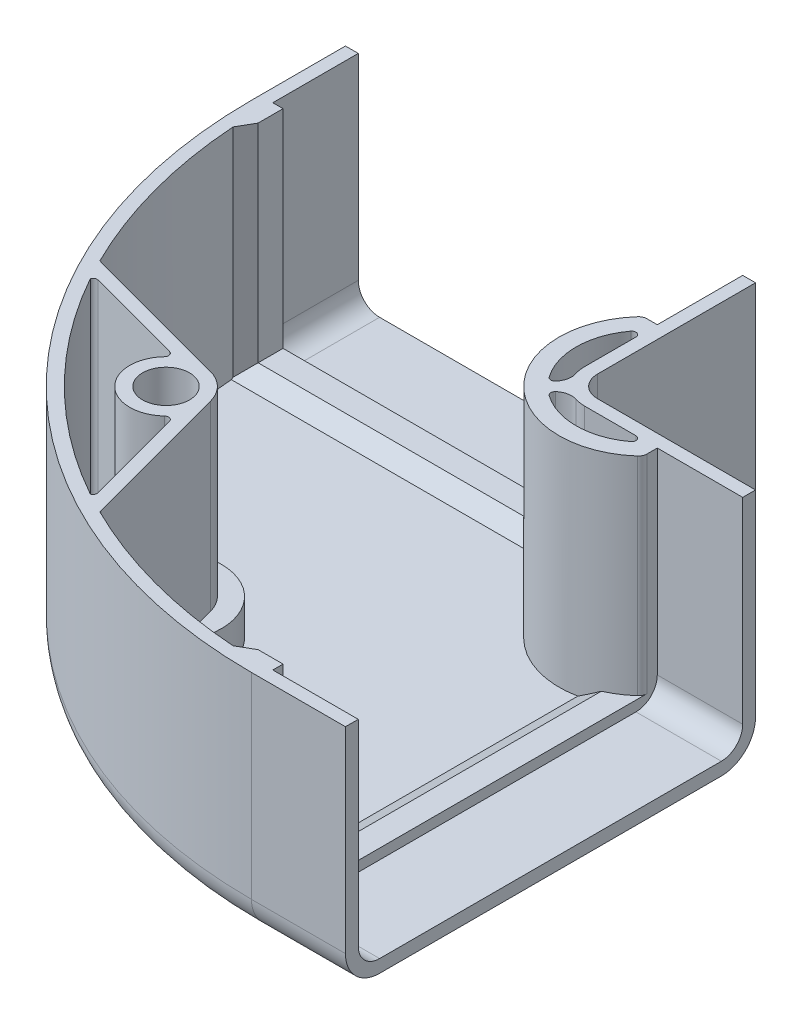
ISO-10303-21;
HEADER;
FILE_DESCRIPTION(('STEP AP214'),'2;1');
FILE_NAME('part.step','',(''),(''),'','','');
FILE_SCHEMA(('AUTOMOTIVE_DESIGN { 1 0 10303 214 1 1 1 1 }'));
ENDSEC;
DATA;
#1=APPLICATION_CONTEXT('core data for automotive mechanical design processes');
#2=APPLICATION_PROTOCOL_DEFINITION('international standard','automotive_design',2000,#1);
#3=PRODUCT_CONTEXT('',#1,'mechanical');
#4=PRODUCT('Part','Part','',(#3));
#5=PRODUCT_RELATED_PRODUCT_CATEGORY('part','',(#4));
#6=PRODUCT_DEFINITION_FORMATION('','',#4);
#7=PRODUCT_DEFINITION_CONTEXT('part definition',#1,'design');
#8=PRODUCT_DEFINITION('design','',#6,#7);
#9=PRODUCT_DEFINITION_SHAPE('','',#8);
#10=(LENGTH_UNIT() NAMED_UNIT(*) SI_UNIT(.MILLI.,.METRE.));
#11=(NAMED_UNIT(*) PLANE_ANGLE_UNIT() SI_UNIT($,.RADIAN.));
#12=(NAMED_UNIT(*) SI_UNIT($,.STERADIAN.) SOLID_ANGLE_UNIT());
#13=UNCERTAINTY_MEASURE_WITH_UNIT(LENGTH_MEASURE(1.E-05),#10,'distance_accuracy_value','');
#14=(GEOMETRIC_REPRESENTATION_CONTEXT(3) GLOBAL_UNCERTAINTY_ASSIGNED_CONTEXT((#13)) GLOBAL_UNIT_ASSIGNED_CONTEXT((#10,
#11,#12)) REPRESENTATION_CONTEXT('',''));
#15=CARTESIAN_POINT('',(0.,0.,0.));
#16=DIRECTION('',(0.,0.,1.));
#17=DIRECTION('',(1.,0.,0.));
#18=AXIS2_PLACEMENT_3D('',#15,#16,#17);
#19=CARTESIAN_POINT('',(-44.9999999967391,4.2,-3.26095E-09));
#20=DIRECTION('',(0.,-1.,0.));
#21=DIRECTION('',(0.,0.,-1.));
#22=AXIS2_PLACEMENT_3D('',#19,#20,#21);
#23=CYLINDRICAL_SURFACE('',#22,6.49999999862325);
#24=CARTESIAN_POINT('',(-44.9999999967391,4.2,-3.26095E-09));
#25=DIRECTION('',(0.,-1.,0.));
#26=DIRECTION('',(0.,0.,-1.));
#27=AXIS2_PLACEMENT_3D('',#24,#25,#26);
#28=CIRCLE('',#27,6.49999999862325);
#29=CARTESIAN_POINT('',(-47.377262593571,4.2,-6.04967954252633));
#30=VERTEX_POINT('',#29);
#31=CARTESIAN_POINT('',(-38.9503204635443,4.2,2.37726260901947));
#32=VERTEX_POINT('',#31);
#33=EDGE_CURVE('E555',#30,#32,#28,.T.);
#34=ORIENTED_EDGE('',*,*,#33,.T.);
#35=DIRECTION('',(0.,-1.,0.));
#36=VECTOR('',#35,1.);
#37=CARTESIAN_POINT('',(-38.95032046,4.2,2.3772626));
#38=LINE('',#37,#36);
#39=CARTESIAN_POINT('',(-38.9503204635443,0.,2.37726260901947));
#40=VERTEX_POINT('',#39);
#41=EDGE_CURVE('E345',#32,#40,#38,.T.);
#42=ORIENTED_EDGE('',*,*,#41,.T.);
#43=CARTESIAN_POINT('',(-44.9999999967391,0.,-3.26095E-09));
#44=DIRECTION('',(0.,-1.,0.));
#45=DIRECTION('',(0.,0.,-1.));
#46=AXIS2_PLACEMENT_3D('',#43,#44,#45);
#47=CIRCLE('',#46,6.49999999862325);
#48=CARTESIAN_POINT('',(-47.377262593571,0.,-6.04967954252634));
#49=VERTEX_POINT('',#48);
#50=EDGE_CURVE('E511',#40,#49,#47,.F.);
#51=ORIENTED_EDGE('',*,*,#50,.T.);
#52=DIRECTION('',(0.,-1.,0.));
#53=VECTOR('',#52,1.);
#54=CARTESIAN_POINT('',(-47.3772626,4.2,-6.04967954));
#55=LINE('',#54,#53);
#56=EDGE_CURVE('E346',#49,#30,#55,.F.);
#57=ORIENTED_EDGE('',*,*,#56,.T.);
#58=EDGE_LOOP('',(#34,#42,#51,#57));
#59=FACE_BOUND('',#58,.T.);
#60=ADVANCED_FACE('F15',(#59),#23,.T.);
#61=CARTESIAN_POINT('',(-49.2059261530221,4.2,-10.7032792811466));
#62=DIRECTION('',(0.,-1.,0.));
#63=DIRECTION('',(0.,0.,-1.));
#64=AXIS2_PLACEMENT_3D('',#61,#62,#63);
#65=CYLINDRICAL_SURFACE('',#64,5.00000009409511);
#66=DIRECTION('',(0.,1.,0.));
#67=VECTOR('',#66,1.);
#68=CARTESIAN_POINT('',(-50.5000213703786,25.5,-5.87365004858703));
#69=LINE('',#68,#67);
#70=CARTESIAN_POINT('',(-50.5000213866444,4.2,-5.87365005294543));
#71=VERTEX_POINT('',#70);
#72=CARTESIAN_POINT('',(-50.5000213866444,0.,-5.87365005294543));
#73=VERTEX_POINT('',#72);
#74=EDGE_CURVE('E456',#71,#73,#69,.F.);
#75=ORIENTED_EDGE('',*,*,#74,.F.);
#76=CARTESIAN_POINT('',(-49.2059261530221,4.2,-10.7032792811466));
#77=DIRECTION('',(0.,-1.,0.));
#78=DIRECTION('',(0.,0.,-1.));
#79=AXIS2_PLACEMENT_3D('',#76,#77,#78);
#80=CIRCLE('',#79,5.00000009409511);
#81=EDGE_CURVE('E557',#71,#30,#80,.F.);
#82=ORIENTED_EDGE('',*,*,#81,.T.);
#83=ORIENTED_EDGE('',*,*,#56,.F.);
#84=CARTESIAN_POINT('',(-49.2059261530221,0.,-10.7032792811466));
#85=DIRECTION('',(0.,-1.,0.));
#86=DIRECTION('',(0.,0.,-1.));
#87=AXIS2_PLACEMENT_3D('',#84,#85,#86);
#88=CIRCLE('',#87,5.00000009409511);
#89=EDGE_CURVE('E509',#49,#73,#88,.T.);
#90=ORIENTED_EDGE('',*,*,#89,.T.);
#91=EDGE_LOOP('',(#75,#82,#83,#90));
#92=FACE_BOUND('',#91,.T.);
#93=ADVANCED_FACE('F1426',(#92),#65,.F.);
#94=CARTESIAN_POINT('',(-61.1207849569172,25.5,-9.75475126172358));
#95=DIRECTION('',(0.,-1.,0.));
#96=DIRECTION('',(0.,0.,-1.));
#97=AXIS2_PLACEMENT_3D('',#94,#95,#96);
#98=CYLINDRICAL_SURFACE('',#97,1.0000000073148);
#99=CARTESIAN_POINT('',(-61.1207849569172,25.5,-9.75475126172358));
#100=DIRECTION('',(0.,-1.,0.));
#101=DIRECTION('',(0.,0.,-1.));
#102=AXIS2_PLACEMENT_3D('',#99,#100,#101);
#103=CIRCLE('',#102,1.0000000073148);
#104=CARTESIAN_POINT('',(-61.3796040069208,25.5,-8.78882542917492));
#105=VERTEX_POINT('',#104);
#106=CARTESIAN_POINT('',(-61.6099112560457,25.5,-8.88253828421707));
#107=VERTEX_POINT('',#106);
#108=EDGE_CURVE('E18',#105,#107,#103,.T.);
#109=ORIENTED_EDGE('',*,*,#108,.F.);
#110=DIRECTION('',(0.,1.,0.));
#111=VECTOR('',#110,1.);
#112=CARTESIAN_POINT('',(-61.37960401,25.5,-8.78882543));
#113=LINE('',#112,#111);
#114=CARTESIAN_POINT('',(-61.3796040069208,0.,-8.78882542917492));
#115=VERTEX_POINT('',#114);
#116=EDGE_CURVE('E849',#115,#105,#113,.T.);
#117=ORIENTED_EDGE('',*,*,#116,.F.);
#118=CARTESIAN_POINT('',(-61.1207849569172,0.,-9.75475126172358));
#119=DIRECTION('',(0.,-1.,0.));
#120=DIRECTION('',(0.,0.,-1.));
#121=AXIS2_PLACEMENT_3D('',#118,#119,#120);
#122=CIRCLE('',#121,1.0000000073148);
#123=CARTESIAN_POINT('',(-61.6099112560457,0.,-8.88253828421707));
#124=VERTEX_POINT('',#123);
#125=EDGE_CURVE('E350',#115,#124,#122,.T.);
#126=ORIENTED_EDGE('',*,*,#125,.T.);
#127=DIRECTION('',(0.,-1.,0.));
#128=VECTOR('',#127,1.);
#129=CARTESIAN_POINT('',(-61.6099112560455,25.5,-8.8825382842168));
#130=LINE('',#129,#128);
#131=EDGE_CURVE('E348',#124,#107,#130,.F.);
#132=ORIENTED_EDGE('',*,*,#131,.T.);
#133=EDGE_LOOP('',(#109,#117,#126,#132));
#134=FACE_BOUND('',#133,.T.);
#135=ADVANCED_FACE('F349',(#134),#98,.F.);
#136=CARTESIAN_POINT('',(-34.2967209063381,4.2,4.20592614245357));
#137=DIRECTION('',(0.,-1.,0.));
#138=DIRECTION('',(0.,0.,-1.));
#139=AXIS2_PLACEMENT_3D('',#136,#137,#138);
#140=CYLINDRICAL_SURFACE('',#139,4.99999991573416);
#141=ORIENTED_EDGE('',*,*,#41,.F.);
#142=CARTESIAN_POINT('',(-34.2967209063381,4.2,4.20592614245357));
#143=DIRECTION('',(0.,-1.,0.));
#144=DIRECTION('',(0.,0.,-1.));
#145=AXIS2_PLACEMENT_3D('',#142,#143,#144);
#146=CIRCLE('',#145,4.99999991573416);
#147=CARTESIAN_POINT('',(-39.1263499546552,4.2,5.50002135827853));
#148=VERTEX_POINT('',#147);
#149=EDGE_CURVE('E552',#32,#148,#146,.F.);
#150=ORIENTED_EDGE('',*,*,#149,.T.);
#151=DIRECTION('',(0.,1.,0.));
#152=VECTOR('',#151,1.);
#153=CARTESIAN_POINT('',(-39.126349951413,25.5,5.50002137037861));
#154=LINE('',#153,#152);
#155=CARTESIAN_POINT('',(-39.1263499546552,0.,5.50002135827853));
#156=VERTEX_POINT('',#155);
#157=EDGE_CURVE('E848',#156,#148,#154,.T.);
#158=ORIENTED_EDGE('',*,*,#157,.F.);
#159=CARTESIAN_POINT('',(-34.2967209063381,0.,4.20592614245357));
#160=DIRECTION('',(0.,-1.,0.));
#161=DIRECTION('',(0.,0.,-1.));
#162=AXIS2_PLACEMENT_3D('',#159,#160,#161);
#163=CIRCLE('',#162,4.99999991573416);
#164=EDGE_CURVE('E514',#156,#40,#163,.T.);
#165=ORIENTED_EDGE('',*,*,#164,.T.);
#166=EDGE_LOOP('',(#141,#150,#158,#165));
#167=FACE_BOUND('',#166,.T.);
#168=ADVANCED_FACE('F1428',(#167),#140,.F.);
#169=CARTESIAN_POINT('',(-42.7301358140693,4.2,-2.26986418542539));
#170=DIRECTION('',(0.,-1.,0.));
#171=DIRECTION('',(0.,0.,-1.));
#172=AXIS2_PLACEMENT_3D('',#169,#170,#171);
#173=PLANE('',#172);
#174=ORIENTED_EDGE('',*,*,#149,.F.);
#175=ORIENTED_EDGE('',*,*,#33,.F.);
#176=ORIENTED_EDGE('',*,*,#81,.F.);
#177=DIRECTION('',(-0.965925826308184,0.,-0.258819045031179));
#178=VECTOR('',#177,1.);
#179=CARTESIAN_POINT('',(-43.90001906,4.2,-4.10518476));
#180=LINE('',#179,#178);
#181=CARTESIAN_POINT('',(-43.9000190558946,4.2,-4.10518475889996));
#182=VERTEX_POINT('',#181);
#183=EDGE_CURVE('E452',#182,#71,#180,.T.);
#184=ORIENTED_EDGE('',*,*,#183,.F.);
#185=CARTESIAN_POINT('',(-44.9999999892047,4.2,-1.0795294E-08));
#186=DIRECTION('',(0.,-1.,0.));
#187=DIRECTION('',(0.,0.,-1.));
#188=AXIS2_PLACEMENT_3D('',#185,#186,#187);
#189=CIRCLE('',#188,4.24999998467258);
#190=CARTESIAN_POINT('',(-40.8948152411,4.2,-1.09998094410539));
#191=VERTEX_POINT('',#190);
#192=EDGE_CURVE('E447',#191,#182,#189,.F.);
#193=ORIENTED_EDGE('',*,*,#192,.F.);
#194=DIRECTION('',(-0.258819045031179,0.,-0.965925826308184));
#195=VECTOR('',#194,1.);
#196=CARTESIAN_POINT('',(-36.21117457,4.2,16.37960401));
#197=LINE('',#196,#195);
#198=EDGE_CURVE('E842',#148,#191,#197,.T.);
#199=ORIENTED_EDGE('',*,*,#198,.F.);
#200=EDGE_LOOP('',(#174,#175,#176,#184,#193,#199));
#201=FACE_BOUND('',#200,.T.);
#202=ADVANCED_FACE('F1420',(#201),#173,.F.);
#203=CARTESIAN_POINT('',(-35.2452487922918,25.5,16.1207850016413));
#204=DIRECTION('',(0.,-1.,0.));
#205=DIRECTION('',(0.,0.,-1.));
#206=AXIS2_PLACEMENT_3D('',#203,#204,#205);
#207=CYLINDRICAL_SURFACE('',#206,0.999999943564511);
#208=CARTESIAN_POINT('',(-35.2452487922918,0.,16.1207850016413));
#209=DIRECTION('',(0.,-1.,0.));
#210=DIRECTION('',(0.,0.,-1.));
#211=AXIS2_PLACEMENT_3D('',#208,#209,#210);
#212=CIRCLE('',#211,0.999999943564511);
#213=CARTESIAN_POINT('',(-36.1174617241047,0.,16.6099112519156));
#214=VERTEX_POINT('',#213);
#215=CARTESIAN_POINT('',(-36.2111745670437,0.,16.379604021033));
#216=VERTEX_POINT('',#215);
#217=EDGE_CURVE('E518',#214,#216,#212,.T.);
#218=ORIENTED_EDGE('',*,*,#217,.T.);
#219=DIRECTION('',(0.,1.,0.));
#220=VECTOR('',#219,1.);
#221=CARTESIAN_POINT('',(-36.21117457,25.5,16.37960401));
#222=LINE('',#221,#220);
#223=CARTESIAN_POINT('',(-36.2111745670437,25.5,16.379604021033));
#224=VERTEX_POINT('',#223);
#225=EDGE_CURVE('E841',#224,#216,#222,.F.);
#226=ORIENTED_EDGE('',*,*,#225,.F.);
#227=CARTESIAN_POINT('',(-35.2452487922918,25.5,16.1207850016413));
#228=DIRECTION('',(0.,-1.,0.));
#229=DIRECTION('',(0.,0.,-1.));
#230=AXIS2_PLACEMENT_3D('',#227,#228,#229);
#231=CIRCLE('',#230,0.999999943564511);
#232=CARTESIAN_POINT('',(-36.1174617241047,25.5,16.6099112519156));
#233=VERTEX_POINT('',#232);
#234=EDGE_CURVE('E549',#233,#224,#231,.T.);
#235=ORIENTED_EDGE('',*,*,#234,.F.);
#236=DIRECTION('',(0.,-1.,0.));
#237=VECTOR('',#236,1.);
#238=CARTESIAN_POINT('',(-36.1174617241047,25.5,16.6099112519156));
#239=LINE('',#238,#237);
#240=EDGE_CURVE('E446',#233,#214,#239,.T.);
#241=ORIENTED_EDGE('',*,*,#240,.T.);
#242=EDGE_LOOP('',(#218,#226,#235,#241));
#243=FACE_BOUND('',#242,.T.);
#244=ADVANCED_FACE('F1411',(#243),#207,.F.);
#245=CARTESIAN_POINT('',(-38.6815219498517,25.5,14.8875486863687));
#246=DIRECTION('',(0.,-1.,0.));
#247=DIRECTION('',(0.,0.,-1.));
#248=AXIS2_PLACEMENT_3D('',#245,#246,#247);
#249=CYLINDRICAL_SURFACE('',#248,0.500000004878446);
#250=CARTESIAN_POINT('',(-38.6815219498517,25.5,14.8875486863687));
#251=DIRECTION('',(0.,-1.,0.));
#252=DIRECTION('',(0.,0.,-1.));
#253=AXIS2_PLACEMENT_3D('',#250,#251,#252);
#254=CIRCLE('',#253,0.500000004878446);
#255=CARTESIAN_POINT('',(-38.1985590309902,25.5,14.7581391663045));
#256=VERTEX_POINT('',#255);
#257=CARTESIAN_POINT('',(-38.5025601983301,25.5,15.3544241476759));
#258=VERTEX_POINT('',#257);
#259=EDGE_CURVE('E546',#256,#258,#254,.T.);
#260=ORIENTED_EDGE('',*,*,#259,.F.);
#261=DIRECTION('',(0.,1.,0.));
#262=VECTOR('',#261,1.);
#263=CARTESIAN_POINT('',(-38.19855903,25.5,14.75813917));
#264=LINE('',#263,#262);
#265=CARTESIAN_POINT('',(-38.1985590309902,0.,14.7581391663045));
#266=VERTEX_POINT('',#265);
#267=EDGE_CURVE('E811',#266,#256,#264,.T.);
#268=ORIENTED_EDGE('',*,*,#267,.F.);
#269=CARTESIAN_POINT('',(-38.6815219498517,0.,14.8875486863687));
#270=DIRECTION('',(0.,-1.,0.));
#271=DIRECTION('',(0.,0.,-1.));
#272=AXIS2_PLACEMENT_3D('',#269,#270,#271);
#273=CIRCLE('',#272,0.500000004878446);
#274=CARTESIAN_POINT('',(-38.5025601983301,0.,15.3544241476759));
#275=VERTEX_POINT('',#274);
#276=EDGE_CURVE('E530',#266,#275,#273,.T.);
#277=ORIENTED_EDGE('',*,*,#276,.T.);
#278=DIRECTION('',(0.,-1.,0.));
#279=VECTOR('',#278,1.);
#280=CARTESIAN_POINT('',(-38.5025601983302,25.5,15.3544241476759));
#281=LINE('',#280,#279);
#282=EDGE_CURVE('E437',#275,#258,#281,.F.);
#283=ORIENTED_EDGE('',*,*,#282,.T.);
#284=EDGE_LOOP('',(#260,#268,#277,#283));
#285=FACE_BOUND('',#284,.T.);
#286=ADVANCED_FACE('F1163',(#285),#249,.F.);
#287=CARTESIAN_POINT('',(-45.,4.2,0.));
#288=DIRECTION('',(0.,1.,0.));
#289=DIRECTION('',(0.,0.,1.));
#290=AXIS2_PLACEMENT_3D('',#287,#288,#289);
#291=PLANE('',#290);
#292=CARTESIAN_POINT('',(-44.9999999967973,4.2,-3.202755E-09));
#293=DIRECTION('',(0.,-1.,0.));
#294=DIRECTION('',(0.,0.,-1.));
#295=AXIS2_PLACEMENT_3D('',#292,#293,#294);
#296=CIRCLE('',#295,4.24999999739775);
#297=CARTESIAN_POINT('',(-48.0943711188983,4.2,-2.91330866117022));
#298=VERTEX_POINT('',#297);
#299=CARTESIAN_POINT('',(-42.0866913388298,4.2,3.09437111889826));
#300=VERTEX_POINT('',#299);
#301=EDGE_CURVE('E427',#298,#300,#296,.F.);
#302=ORIENTED_EDGE('',*,*,#301,.F.);
#303=CARTESIAN_POINT('',(-48.4584147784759,4.2,-3.25605085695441));
#304=DIRECTION('',(0.,-1.,0.));
#305=DIRECTION('',(0.,0.,-1.));
#306=AXIS2_PLACEMENT_3D('',#303,#304,#305);
#307=CIRCLE('',#306,0.499999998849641);
#308=CARTESIAN_POINT('',(-48.3290052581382,4.2,-3.73901376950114));
#309=VERTEX_POINT('',#308);
#310=EDGE_CURVE('E534',#298,#309,#307,.F.);
#311=ORIENTED_EDGE('',*,*,#310,.T.);
#312=DIRECTION('',(-0.965925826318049,0.,-0.258819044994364));
#313=VECTOR('',#312,1.);
#314=CARTESIAN_POINT('',(-48.32900526,4.2,-3.73901377));
#315=LINE('',#314,#313);
#316=CARTESIAN_POINT('',(-49.9771735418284,4.2,-4.1806391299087));
#317=VERTEX_POINT('',#316);
#318=EDGE_CURVE('E545',#309,#317,#315,.T.);
#319=ORIENTED_EDGE('',*,*,#318,.T.);
#320=CARTESIAN_POINT('',(-45.,4.2,0.));
#321=DIRECTION('',(0.,-1.,0.));
#322=DIRECTION('',(0.,0.,-1.));
#323=AXIS2_PLACEMENT_3D('',#320,#321,#322);
#324=CIRCLE('',#323,6.5);
#325=CARTESIAN_POINT('',(-40.8193608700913,4.2,4.97717354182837));
#326=VERTEX_POINT('',#325);
#327=EDGE_CURVE('E520',#326,#317,#324,.T.);
#328=ORIENTED_EDGE('',*,*,#327,.F.);
#329=DIRECTION('',(0.258819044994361,0.,0.96592582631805));
#330=VECTOR('',#329,1.);
#331=CARTESIAN_POINT('',(-41.26098623,4.2,3.32900526));
#332=LINE('',#331,#330);
#333=CARTESIAN_POINT('',(-41.2609862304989,4.2,3.32900525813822));
#334=VERTEX_POINT('',#333);
#335=EDGE_CURVE('E826',#334,#326,#332,.T.);
#336=ORIENTED_EDGE('',*,*,#335,.F.);
#337=CARTESIAN_POINT('',(-41.7439491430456,4.2,3.45841477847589));
#338=DIRECTION('',(0.,-1.,0.));
#339=DIRECTION('',(0.,0.,-1.));
#340=AXIS2_PLACEMENT_3D('',#337,#338,#339);
#341=CIRCLE('',#340,0.499999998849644);
#342=EDGE_CURVE('E539',#334,#300,#341,.F.);
#343=ORIENTED_EDGE('',*,*,#342,.T.);
#344=EDGE_LOOP('',(#302,#311,#319,#328,#336,#343));
#345=FACE_BOUND('',#344,.T.);
#346=ADVANCED_FACE('F1150',(#345),#291,.T.);
#347=CARTESIAN_POINT('',(-41.7439491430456,25.5,3.45841477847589));
#348=DIRECTION('',(0.,-1.,0.));
#349=DIRECTION('',(0.,0.,-1.));
#350=AXIS2_PLACEMENT_3D('',#347,#348,#349);
#351=CYLINDRICAL_SURFACE('',#350,0.499999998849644);
#352=DIRECTION('',(0.,1.,0.));
#353=VECTOR('',#352,1.);
#354=CARTESIAN_POINT('',(-41.26098623,25.5,3.32900526));
#355=LINE('',#354,#353);
#356=CARTESIAN_POINT('',(-41.2609862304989,25.5,3.32900525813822));
#357=VERTEX_POINT('',#356);
#358=EDGE_CURVE('E432',#357,#334,#355,.F.);
#359=ORIENTED_EDGE('',*,*,#358,.F.);
#360=CARTESIAN_POINT('',(-41.7439491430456,25.5,3.45841477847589));
#361=DIRECTION('',(0.,-1.,0.));
#362=DIRECTION('',(0.,0.,-1.));
#363=AXIS2_PLACEMENT_3D('',#360,#361,#362);
#364=CIRCLE('',#363,0.499999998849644);
#365=CARTESIAN_POINT('',(-42.0866913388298,25.5,3.09437111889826));
#366=VERTEX_POINT('',#365);
#367=EDGE_CURVE('E542',#366,#357,#364,.T.);
#368=ORIENTED_EDGE('',*,*,#367,.F.);
#369=DIRECTION('',(0.,-1.,0.));
#370=VECTOR('',#369,1.);
#371=CARTESIAN_POINT('',(-42.08669134,25.5,3.09437112));
#372=LINE('',#371,#370);
#373=EDGE_CURVE('E431',#300,#366,#372,.F.);
#374=ORIENTED_EDGE('',*,*,#373,.F.);
#375=ORIENTED_EDGE('',*,*,#342,.F.);
#376=EDGE_LOOP('',(#359,#368,#374,#375));
#377=FACE_BOUND('',#376,.T.);
#378=ADVANCED_FACE('F1148',(#377),#351,.F.);
#379=CARTESIAN_POINT('',(-48.4584147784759,25.5,-3.25605085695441));
#380=DIRECTION('',(0.,-1.,0.));
#381=DIRECTION('',(0.,0.,-1.));
#382=AXIS2_PLACEMENT_3D('',#379,#380,#381);
#383=CYLINDRICAL_SURFACE('',#382,0.499999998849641);
#384=DIRECTION('',(0.,-1.,0.));
#385=VECTOR('',#384,1.);
#386=CARTESIAN_POINT('',(-48.09437112,25.5,-2.91330866));
#387=LINE('',#386,#385);
#388=CARTESIAN_POINT('',(-48.0943711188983,25.5,-2.91330866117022));
#389=VERTEX_POINT('',#388);
#390=EDGE_CURVE('E801',#389,#298,#387,.T.);
#391=ORIENTED_EDGE('',*,*,#390,.F.);
#392=CARTESIAN_POINT('',(-48.4584147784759,25.5,-3.25605085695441));
#393=DIRECTION('',(0.,-1.,0.));
#394=DIRECTION('',(0.,0.,-1.));
#395=AXIS2_PLACEMENT_3D('',#392,#393,#394);
#396=CIRCLE('',#395,0.499999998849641);
#397=CARTESIAN_POINT('',(-48.3290052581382,25.5,-3.73901376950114));
#398=VERTEX_POINT('',#397);
#399=EDGE_CURVE('E537',#398,#389,#396,.T.);
#400=ORIENTED_EDGE('',*,*,#399,.F.);
#401=DIRECTION('',(0.,1.,0.));
#402=VECTOR('',#401,1.);
#403=CARTESIAN_POINT('',(-48.32900526,25.5,-3.73901377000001));
#404=LINE('',#403,#402);
#405=EDGE_CURVE('E797',#309,#398,#404,.T.);
#406=ORIENTED_EDGE('',*,*,#405,.F.);
#407=ORIENTED_EDGE('',*,*,#310,.F.);
#408=EDGE_LOOP('',(#391,#400,#406,#407));
#409=FACE_BOUND('',#408,.T.);
#410=ADVANCED_FACE('F1175',(#409),#383,.F.);
#411=CARTESIAN_POINT('',(-59.8875486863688,25.5,-6.31847805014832));
#412=DIRECTION('',(0.,-1.,0.));
#413=DIRECTION('',(0.,0.,-1.));
#414=AXIS2_PLACEMENT_3D('',#411,#412,#413);
#415=CYLINDRICAL_SURFACE('',#414,0.500000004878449);
#416=CARTESIAN_POINT('',(-59.8875486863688,0.,-6.31847805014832));
#417=DIRECTION('',(0.,-1.,0.));
#418=DIRECTION('',(0.,0.,-1.));
#419=AXIS2_PLACEMENT_3D('',#416,#417,#418);
#420=CIRCLE('',#419,0.500000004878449);
#421=CARTESIAN_POINT('',(-60.3544241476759,0.,-6.49743980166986));
#422=VERTEX_POINT('',#421);
#423=CARTESIAN_POINT('',(-59.7581391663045,0.,-6.80144096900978));
#424=VERTEX_POINT('',#423);
#425=EDGE_CURVE('E527',#422,#424,#420,.T.);
#426=ORIENTED_EDGE('',*,*,#425,.T.);
#427=DIRECTION('',(0.,1.,0.));
#428=VECTOR('',#427,1.);
#429=CARTESIAN_POINT('',(-59.75813917,25.5,-6.80144097));
#430=LINE('',#429,#428);
#431=CARTESIAN_POINT('',(-59.7581391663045,25.5,-6.80144096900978));
#432=VERTEX_POINT('',#431);
#433=EDGE_CURVE('E800',#432,#424,#430,.F.);
#434=ORIENTED_EDGE('',*,*,#433,.F.);
#435=CARTESIAN_POINT('',(-59.8875486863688,25.5,-6.31847805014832));
#436=DIRECTION('',(0.,-1.,0.));
#437=DIRECTION('',(0.,0.,-1.));
#438=AXIS2_PLACEMENT_3D('',#435,#436,#437);
#439=CIRCLE('',#438,0.500000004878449);
#440=CARTESIAN_POINT('',(-60.3544241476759,25.5,-6.49743980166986));
#441=VERTEX_POINT('',#440);
#442=EDGE_CURVE('E532',#441,#432,#439,.T.);
#443=ORIENTED_EDGE('',*,*,#442,.F.);
#444=DIRECTION('',(0.,-1.,0.));
#445=VECTOR('',#444,1.);
#446=CARTESIAN_POINT('',(-60.3544241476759,25.5,-6.49743980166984));
#447=LINE('',#446,#445);
#448=EDGE_CURVE('E822',#441,#422,#447,.T.);
#449=ORIENTED_EDGE('',*,*,#448,.T.);
#450=EDGE_LOOP('',(#426,#434,#443,#449));
#451=FACE_BOUND('',#450,.T.);
#452=ADVANCED_FACE('F1169',(#451),#415,.F.);
#453=CARTESIAN_POINT('',(-31.3380494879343,0.,-13.6619505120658));
#454=DIRECTION('',(0.,-1.,0.));
#455=DIRECTION('',(0.,0.,-1.));
#456=AXIS2_PLACEMENT_3D('',#453,#454,#455);
#457=PLANE('',#456);
#458=DIRECTION('',(0.96592582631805,0.,0.258819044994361));
#459=VECTOR('',#458,1.);
#460=CARTESIAN_POINT('',(-59.75813917,0.,-6.80144097));
#461=LINE('',#460,#459);
#462=CARTESIAN_POINT('',(-49.9771735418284,0.,-4.1806391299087));
#463=VERTEX_POINT('',#462);
#464=EDGE_CURVE('E805',#424,#463,#461,.T.);
#465=ORIENTED_EDGE('',*,*,#464,.F.);
#466=ORIENTED_EDGE('',*,*,#425,.F.);
#467=CARTESIAN_POINT('',(-11.0000000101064,0.,-33.9999999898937));
#468=DIRECTION('',(0.,-1.,0.));
#469=DIRECTION('',(0.,0.,-1.));
#470=AXIS2_PLACEMENT_3D('',#467,#468,#469);
#471=CIRCLE('',#470,56.4999999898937);
#472=EDGE_CURVE('E433',#422,#275,#471,.F.);
#473=ORIENTED_EDGE('',*,*,#472,.T.);
#474=ORIENTED_EDGE('',*,*,#276,.F.);
#475=DIRECTION('',(0.258819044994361,0.,0.96592582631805));
#476=VECTOR('',#475,1.);
#477=CARTESIAN_POINT('',(-41.26098623,0.,3.32900526));
#478=LINE('',#477,#476);
#479=CARTESIAN_POINT('',(-40.8193608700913,0.,4.97717354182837));
#480=VERTEX_POINT('',#479);
#481=EDGE_CURVE('E815',#480,#266,#478,.T.);
#482=ORIENTED_EDGE('',*,*,#481,.F.);
#483=CARTESIAN_POINT('',(-45.,0.,0.));
#484=DIRECTION('',(0.,-1.,0.));
#485=DIRECTION('',(0.,0.,-1.));
#486=AXIS2_PLACEMENT_3D('',#483,#484,#485);
#487=CIRCLE('',#486,6.5);
#488=EDGE_CURVE('E524',#463,#480,#487,.F.);
#489=ORIENTED_EDGE('',*,*,#488,.F.);
#490=EDGE_LOOP('',(#465,#466,#473,#474,#482,#489));
#491=FACE_BOUND('',#490,.T.);
#492=ADVANCED_FACE('F1159',(#491),#457,.F.);
#493=CARTESIAN_POINT('',(-45.,2.1,0.));
#494=DIRECTION('',(0.,-1.,0.));
#495=DIRECTION('',(0.,0.,-1.));
#496=AXIS2_PLACEMENT_3D('',#493,#494,#495);
#497=CYLINDRICAL_SURFACE('',#496,6.5);
#498=DIRECTION('',(0.,1.,0.));
#499=VECTOR('',#498,1.);
#500=CARTESIAN_POINT('',(-40.8193608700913,25.5,4.97717354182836));
#501=LINE('',#500,#499);
#502=EDGE_CURVE('E896',#326,#480,#501,.F.);
#503=ORIENTED_EDGE('',*,*,#502,.F.);
#504=ORIENTED_EDGE('',*,*,#327,.T.);
#505=DIRECTION('',(0.,1.,0.));
#506=VECTOR('',#505,1.);
#507=CARTESIAN_POINT('',(-49.9771735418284,25.5,-4.1806391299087));
#508=LINE('',#507,#506);
#509=EDGE_CURVE('E426',#463,#317,#508,.T.);
#510=ORIENTED_EDGE('',*,*,#509,.F.);
#511=ORIENTED_EDGE('',*,*,#488,.T.);
#512=EDGE_LOOP('',(#503,#504,#510,#511));
#513=FACE_BOUND('',#512,.T.);
#514=ADVANCED_FACE('F1155',(#513),#497,.T.);
#515=CARTESIAN_POINT('',(-22.5,1.2,-32.07845335));
#516=DIRECTION('',(0.,0.866025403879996,0.49999999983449));
#517=DIRECTION('',(0.,-0.49999999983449,0.866025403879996));
#518=AXIS2_PLACEMENT_3D('',#515,#516,#517);
#519=PLANE('',#518);
#520=CARTESIAN_POINT('',(-16.9999999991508,-1.15469613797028,-28.0000000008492));
#521=DIRECTION('',(0.,0.866025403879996,0.49999999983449));
#522=DIRECTION('',(0.,-0.49999999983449,0.866025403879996));
#523=AXIS2_PLACEMENT_3D('',#520,#521,#522);
#524=ELLIPSE('',#523,11.5470053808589,9.99999999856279);
#525=CARTESIAN_POINT('',(-26.1305102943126,1.2,-32.07845335));
#526=VERTEX_POINT('',#525);
#527=CARTESIAN_POINT('',(-26.7979605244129,0.,-29.99999238));
#528=VERTEX_POINT('',#527);
#529=EDGE_CURVE('E414',#526,#528,#524,.T.);
#530=ORIENTED_EDGE('',*,*,#529,.F.);
#531=DIRECTION('',(1.,0.,0.));
#532=VECTOR('',#531,1.);
#533=CARTESIAN_POINT('',(-22.5,1.2,-32.07845335));
#534=LINE('',#533,#532);
#535=CARTESIAN_POINT('',(-66.3,1.2,-32.07845335));
#536=VERTEX_POINT('',#535);
#537=EDGE_CURVE('E463',#536,#526,#534,.T.);
#538=ORIENTED_EDGE('',*,*,#537,.F.);
#539=DIRECTION('',(0.44721359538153,0.447213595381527,-0.774596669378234));
#540=VECTOR('',#539,1.);
#541=CARTESIAN_POINT('',(-67.3733670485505,0.126632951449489,-30.2193270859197));
#542=LINE('',#541,#540);
#543=CARTESIAN_POINT('',(-67.3733670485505,0.126632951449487,-30.2193270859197));
#544=VERTEX_POINT('',#543);
#545=EDGE_CURVE('E856',#544,#536,#542,.T.);
#546=ORIENTED_EDGE('',*,*,#545,.F.);
#547=CARTESIAN_POINT('',(-11.0000000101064,2.30940546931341,-33.9999999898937));
#548=DIRECTION('',(0.,0.866025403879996,0.49999999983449));
#549=DIRECTION('',(0.,-0.49999999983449,0.866025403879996));
#550=AXIS2_PLACEMENT_3D('',#547,#548,#549);
#551=ELLIPSE('',#550,65.2405803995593,56.4999999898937);
#552=CARTESIAN_POINT('',(-67.3582286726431,0.,-29.99999238));
#553=VERTEX_POINT('',#552);
#554=EDGE_CURVE('E453',#544,#553,#551,.T.);
#555=ORIENTED_EDGE('',*,*,#554,.T.);
#556=DIRECTION('',(1.,0.,0.));
#557=VECTOR('',#556,1.);
#558=CARTESIAN_POINT('',(-31.3380494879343,0.,-29.99999238));
#559=LINE('',#558,#557);
#560=EDGE_CURVE('E508',#553,#528,#559,.T.);
#561=ORIENTED_EDGE('',*,*,#560,.T.);
#562=EDGE_LOOP('',(#530,#538,#546,#555,#561));
#563=FACE_BOUND('',#562,.T.);
#564=ADVANCED_FACE('F930',(#563),#519,.T.);
#565=CARTESIAN_POINT('',(-31.3380494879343,0.,-13.6619505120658));
#566=DIRECTION('',(0.,-1.,0.));
#567=DIRECTION('',(0.,0.,-1.));
#568=AXIS2_PLACEMENT_3D('',#565,#566,#567);
#569=PLANE('',#568);
#570=CARTESIAN_POINT('',(-16.9999999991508,0.,-28.0000000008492));
#571=DIRECTION('',(0.,-1.,0.));
#572=DIRECTION('',(0.,0.,-1.));
#573=AXIS2_PLACEMENT_3D('',#570,#571,#572);
#574=CIRCLE('',#573,9.99999999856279);
#575=CARTESIAN_POINT('',(-15.00000762,0.,-18.2020394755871));
#576=VERTEX_POINT('',#575);
#577=EDGE_CURVE('E410',#528,#576,#574,.F.);
#578=ORIENTED_EDGE('',*,*,#577,.F.);
#579=ORIENTED_EDGE('',*,*,#560,.F.);
#580=CARTESIAN_POINT('',(-11.0000000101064,0.,-33.9999999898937));
#581=DIRECTION('',(0.,-1.,0.));
#582=DIRECTION('',(0.,0.,-1.));
#583=AXIS2_PLACEMENT_3D('',#580,#581,#582);
#584=CIRCLE('',#583,56.4999999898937);
#585=EDGE_CURVE('E356',#553,#124,#584,.F.);
#586=ORIENTED_EDGE('',*,*,#585,.T.);
#587=ORIENTED_EDGE('',*,*,#125,.F.);
#588=DIRECTION('',(-0.965925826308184,0.,-0.258819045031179));
#589=VECTOR('',#588,1.);
#590=CARTESIAN_POINT('',(-43.90001906,0.,-4.10518476));
#591=LINE('',#590,#589);
#592=EDGE_CURVE('E851',#73,#115,#591,.T.);
#593=ORIENTED_EDGE('',*,*,#592,.F.);
#594=ORIENTED_EDGE('',*,*,#89,.F.);
#595=ORIENTED_EDGE('',*,*,#50,.F.);
#596=ORIENTED_EDGE('',*,*,#164,.F.);
#597=DIRECTION('',(-0.258819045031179,0.,-0.965925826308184));
#598=VECTOR('',#597,1.);
#599=CARTESIAN_POINT('',(-36.21117457,0.,16.37960401));
#600=LINE('',#599,#598);
#601=EDGE_CURVE('E837',#216,#156,#600,.T.);
#602=ORIENTED_EDGE('',*,*,#601,.F.);
#603=ORIENTED_EDGE('',*,*,#217,.F.);
#604=CARTESIAN_POINT('',(-11.0000000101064,0.,-33.9999999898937));
#605=DIRECTION('',(0.,-1.,0.));
#606=DIRECTION('',(0.,0.,-1.));
#607=AXIS2_PLACEMENT_3D('',#604,#605,#606);
#608=CIRCLE('',#607,56.4999999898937);
#609=CARTESIAN_POINT('',(-15.00000762,0.,22.358228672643));
#610=VERTEX_POINT('',#609);
#611=EDGE_CURVE('E443',#214,#610,#608,.F.);
#612=ORIENTED_EDGE('',*,*,#611,.T.);
#613=DIRECTION('',(0.,0.,1.));
#614=VECTOR('',#613,1.);
#615=CARTESIAN_POINT('',(-15.00000762,0.,22.5));
#616=LINE('',#615,#614);
#617=EDGE_CURVE('E506',#576,#610,#616,.T.);
#618=ORIENTED_EDGE('',*,*,#617,.F.);
#619=EDGE_LOOP('',(#578,#579,#586,#587,#593,#594,#595,#596,#602,#603,#612,#618));
#620=FACE_BOUND('',#619,.T.);
#621=ADVANCED_FACE('F1405',(#620),#569,.F.);
#622=CARTESIAN_POINT('',(-12.92154665,1.2,22.5));
#623=DIRECTION('',(-0.49999999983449,0.866025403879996,0.));
#624=DIRECTION('',(-0.866025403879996,-0.49999999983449,0.));
#625=AXIS2_PLACEMENT_3D('',#622,#623,#624);
#626=PLANE('',#625);
#627=DIRECTION('',(-0.774596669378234,-0.447213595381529,0.447213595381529));
#628=VECTOR('',#627,1.);
#629=CARTESIAN_POINT('',(-12.92154665,1.2,21.3));
#630=LINE('',#629,#628);
#631=CARTESIAN_POINT('',(-12.92154665,1.2,21.3));
#632=VERTEX_POINT('',#631);
#633=CARTESIAN_POINT('',(-14.7806729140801,0.126632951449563,22.3733670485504));
#634=VERTEX_POINT('',#633);
#635=EDGE_CURVE('E442',#632,#634,#630,.T.);
#636=ORIENTED_EDGE('',*,*,#635,.F.);
#637=DIRECTION('',(0.,0.,1.));
#638=VECTOR('',#637,1.);
#639=CARTESIAN_POINT('',(-12.92154665,1.2,22.5));
#640=LINE('',#639,#638);
#641=CARTESIAN_POINT('',(-12.92154665,1.2,-18.8694897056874));
#642=VERTEX_POINT('',#641);
#643=EDGE_CURVE('E467',#642,#632,#640,.T.);
#644=ORIENTED_EDGE('',*,*,#643,.F.);
#645=CARTESIAN_POINT('',(-16.9999999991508,-1.15469613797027,-28.0000000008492));
#646=DIRECTION('',(-0.49999999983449,0.866025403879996,0.));
#647=DIRECTION('',(-0.866025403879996,-0.49999999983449,0.));
#648=AXIS2_PLACEMENT_3D('',#645,#646,#647);
#649=ELLIPSE('',#648,11.5470053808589,9.99999999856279);
#650=EDGE_CURVE('E406',#576,#642,#649,.T.);
#651=ORIENTED_EDGE('',*,*,#650,.F.);
#652=ORIENTED_EDGE('',*,*,#617,.T.);
#653=CARTESIAN_POINT('',(-11.0000000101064,2.30940546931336,-33.9999999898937));
#654=DIRECTION('',(-0.49999999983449,0.866025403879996,0.));
#655=DIRECTION('',(-0.866025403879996,-0.49999999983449,0.));
#656=AXIS2_PLACEMENT_3D('',#653,#654,#655);
#657=ELLIPSE('',#656,65.2405803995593,56.4999999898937);
#658=EDGE_CURVE('E439',#610,#634,#657,.T.);
#659=ORIENTED_EDGE('',*,*,#658,.T.);
#660=EDGE_LOOP('',(#636,#644,#651,#652,#659));
#661=FACE_BOUND('',#660,.T.);
#662=ADVANCED_FACE('F1401',(#661),#626,.T.);
#663=CARTESIAN_POINT('',(-21.3442788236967,0.,-21.8863070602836));
#664=DIRECTION('',(0.,1.,0.));
#665=DIRECTION('',(0.,0.,1.));
#666=AXIS2_PLACEMENT_3D('',#663,#664,#665);
#667=CYLINDRICAL_SURFACE('',#666,0.500000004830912);
#668=DIRECTION('',(0.,1.,0.));
#669=VECTOR('',#668,1.);
#670=CARTESIAN_POINT('',(-21.63389742,0.,-21.47872753));
#671=LINE('',#670,#669);
#672=CARTESIAN_POINT('',(-21.6338974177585,25.5,-21.4787275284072));
#673=VERTEX_POINT('',#672);
#674=CARTESIAN_POINT('',(-21.6338974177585,0.,-21.4787275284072));
#675=VERTEX_POINT('',#674);
#676=EDGE_CURVE('E399',#673,#675,#671,.F.);
#677=ORIENTED_EDGE('',*,*,#676,.T.);
#678=CARTESIAN_POINT('',(-21.3442788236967,0.,-21.8863070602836));
#679=DIRECTION('',(0.,1.,0.));
#680=DIRECTION('',(0.,0.,1.));
#681=AXIS2_PLACEMENT_3D('',#678,#679,#680);
#682=CIRCLE('',#681,0.500000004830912);
#683=CARTESIAN_POINT('',(-21.6836277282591,0.,-22.2535158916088));
#684=VERTEX_POINT('',#683);
#685=EDGE_CURVE('E497',#684,#675,#682,.T.);
#686=ORIENTED_EDGE('',*,*,#685,.F.);
#687=DIRECTION('',(0.,1.,0.));
#688=VECTOR('',#687,1.);
#689=CARTESIAN_POINT('',(-21.68362773,0.,-22.25351589));
#690=LINE('',#689,#688);
#691=CARTESIAN_POINT('',(-21.6836277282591,25.5,-22.2535158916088));
#692=VERTEX_POINT('',#691);
#693=EDGE_CURVE('E404',#684,#692,#690,.T.);
#694=ORIENTED_EDGE('',*,*,#693,.T.);
#695=CARTESIAN_POINT('',(-21.3442788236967,25.5,-21.8863070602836));
#696=DIRECTION('',(0.,1.,0.));
#697=DIRECTION('',(0.,0.,1.));
#698=AXIS2_PLACEMENT_3D('',#695,#696,#697);
#699=CIRCLE('',#698,0.500000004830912);
#700=EDGE_CURVE('E504',#673,#692,#699,.F.);
#701=ORIENTED_EDGE('',*,*,#700,.F.);
#702=EDGE_LOOP('',(#677,#686,#694,#701));
#703=FACE_BOUND('',#702,.T.);
#704=ADVANCED_FACE('F1769',(#703),#667,.F.);
#705=CARTESIAN_POINT('',(-12.5000000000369,0.,-21.9999999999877));
#706=DIRECTION('',(0.,1.,0.));
#707=DIRECTION('',(0.,0.,1.));
#708=AXIS2_PLACEMENT_3D('',#705,#706,#707);
#709=CYLINDRICAL_SURFACE('',#708,0.500000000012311);
#710=DIRECTION('',(0.,1.,0.));
#711=VECTOR('',#710,1.);
#712=CARTESIAN_POINT('',(-12.5,0.,-22.5));
#713=LINE('',#712,#711);
#714=CARTESIAN_POINT('',(-12.5000000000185,25.5,-22.5));
#715=VERTEX_POINT('',#714);
#716=CARTESIAN_POINT('',(-12.5000000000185,0.,-22.5));
#717=VERTEX_POINT('',#716);
#718=EDGE_CURVE('E768',#715,#717,#713,.F.);
#719=ORIENTED_EDGE('',*,*,#718,.T.);
#720=CARTESIAN_POINT('',(-12.5000000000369,0.,-21.9999999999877));
#721=DIRECTION('',(0.,1.,0.));
#722=DIRECTION('',(0.,0.,1.));
#723=AXIS2_PLACEMENT_3D('',#720,#721,#722);
#724=CIRCLE('',#723,0.500000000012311);
#725=CARTESIAN_POINT('',(-12.1999999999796,0.,-21.6000000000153));
#726=VERTEX_POINT('',#725);
#727=EDGE_CURVE('E493',#726,#717,#724,.T.);
#728=ORIENTED_EDGE('',*,*,#727,.F.);
#729=DIRECTION('',(0.,1.,0.));
#730=VECTOR('',#729,1.);
#731=CARTESIAN_POINT('',(-12.2,0.,-21.6));
#732=LINE('',#731,#730);
#733=CARTESIAN_POINT('',(-12.1999999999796,25.5,-21.6000000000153));
#734=VERTEX_POINT('',#733);
#735=EDGE_CURVE('E398',#726,#734,#732,.T.);
#736=ORIENTED_EDGE('',*,*,#735,.T.);
#737=CARTESIAN_POINT('',(-12.5000000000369,25.5,-21.9999999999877));
#738=DIRECTION('',(0.,1.,0.));
#739=DIRECTION('',(0.,0.,1.));
#740=AXIS2_PLACEMENT_3D('',#737,#738,#739);
#741=CIRCLE('',#740,0.500000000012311);
#742=EDGE_CURVE('E501',#715,#734,#741,.F.);
#743=ORIENTED_EDGE('',*,*,#742,.F.);
#744=EDGE_LOOP('',(#719,#728,#736,#743));
#745=FACE_BOUND('',#744,.T.);
#746=ADVANCED_FACE('F1572',(#745),#709,.F.);
#747=CARTESIAN_POINT('',(-16.9413824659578,0.,-21.5895327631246));
#748=DIRECTION('',(0.,1.,0.));
#749=DIRECTION('',(0.,0.,1.));
#750=AXIS2_PLACEMENT_3D('',#747,#748,#749);
#751=PLANE('',#750);
#752=ORIENTED_EDGE('',*,*,#727,.T.);
#753=DIRECTION('',(-1.,0.,0.));
#754=VECTOR('',#753,1.);
#755=CARTESIAN_POINT('',(-18.5,0.,-22.5));
#756=LINE('',#755,#754);
#757=CARTESIAN_POINT('',(-18.5000000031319,0.,-22.5));
#758=VERTEX_POINT('',#757);
#759=EDGE_CURVE('E771',#717,#758,#756,.T.);
#760=ORIENTED_EDGE('',*,*,#759,.T.);
#761=CARTESIAN_POINT('',(-18.5000000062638,0.,-26.4999998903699));
#762=DIRECTION('',(0.,1.,0.));
#763=DIRECTION('',(0.,0.,1.));
#764=AXIS2_PLACEMENT_3D('',#761,#762,#763);
#765=CIRCLE('',#764,3.9999998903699);
#766=CARTESIAN_POINT('',(-19.7174880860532,0.,-22.6897870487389));
#767=VERTEX_POINT('',#766);
#768=EDGE_CURVE('E487',#767,#758,#765,.T.);
#769=ORIENTED_EDGE('',*,*,#768,.F.);
#770=CARTESIAN_POINT('',(-20.3262321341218,0.,-20.7846805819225));
#771=DIRECTION('',(0.,1.,0.));
#772=DIRECTION('',(0.,0.,1.));
#773=AXIS2_PLACEMENT_3D('',#770,#771,#772);
#774=CIRCLE('',#773,1.99999999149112);
#775=EDGE_CURVE('E400',#767,#684,#774,.T.);
#776=ORIENTED_EDGE('',*,*,#775,.T.);
#777=ORIENTED_EDGE('',*,*,#685,.T.);
#778=CARTESIAN_POINT('',(-16.9999999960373,0.,-27.9999999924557));
#779=DIRECTION('',(0.,1.,0.));
#780=DIRECTION('',(0.,0.,1.));
#781=AXIS2_PLACEMENT_3D('',#778,#779,#780);
#782=CIRCLE('',#781,7.99999999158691);
#783=EDGE_CURVE('E394',#675,#726,#782,.T.);
#784=ORIENTED_EDGE('',*,*,#783,.T.);
#785=EDGE_LOOP('',(#752,#760,#769,#776,#777,#784));
#786=FACE_BOUND('',#785,.T.);
#787=ADVANCED_FACE('F1567',(#786),#751,.T.);
#788=CARTESIAN_POINT('',(-18.5000000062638,0.,-26.4999998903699));
#789=DIRECTION('',(0.,1.,0.));
#790=DIRECTION('',(0.,0.,1.));
#791=AXIS2_PLACEMENT_3D('',#788,#789,#790);
#792=CYLINDRICAL_SURFACE('',#791,3.9999998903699);
#793=ORIENTED_EDGE('',*,*,#768,.T.);
#794=DIRECTION('',(0.,1.,0.));
#795=VECTOR('',#794,1.);
#796=CARTESIAN_POINT('',(-18.5,0.,-22.5));
#797=LINE('',#796,#795);
#798=CARTESIAN_POINT('',(-18.5000000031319,25.5,-22.5));
#799=VERTEX_POINT('',#798);
#800=EDGE_CURVE('E765',#758,#799,#797,.T.);
#801=ORIENTED_EDGE('',*,*,#800,.T.);
#802=CARTESIAN_POINT('',(-18.5000000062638,25.5,-26.4999998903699));
#803=DIRECTION('',(0.,1.,0.));
#804=DIRECTION('',(0.,0.,1.));
#805=AXIS2_PLACEMENT_3D('',#802,#803,#804);
#806=CIRCLE('',#805,3.9999998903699);
#807=CARTESIAN_POINT('',(-19.7174880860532,25.5,-22.6897870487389));
#808=VERTEX_POINT('',#807);
#809=EDGE_CURVE('E491',#799,#808,#806,.F.);
#810=ORIENTED_EDGE('',*,*,#809,.T.);
#811=DIRECTION('',(0.,1.,0.));
#812=VECTOR('',#811,1.);
#813=CARTESIAN_POINT('',(-19.71748809,0.,-22.68978705));
#814=LINE('',#813,#812);
#815=EDGE_CURVE('E405',#808,#767,#814,.F.);
#816=ORIENTED_EDGE('',*,*,#815,.T.);
#817=EDGE_LOOP('',(#793,#801,#810,#816));
#818=FACE_BOUND('',#817,.T.);
#819=ADVANCED_FACE('F1571',(#818),#792,.T.);
#820=CARTESIAN_POINT('',(-23.1136929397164,25.5,-23.6557211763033));
#821=DIRECTION('',(0.,-1.,0.));
#822=DIRECTION('',(0.,0.,-1.));
#823=AXIS2_PLACEMENT_3D('',#820,#821,#822);
#824=CYLINDRICAL_SURFACE('',#823,0.500000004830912);
#825=DIRECTION('',(0.,-1.,0.));
#826=VECTOR('',#825,1.);
#827=CARTESIAN_POINT('',(-23.52127247,25.5,-23.36610258));
#828=LINE('',#827,#826);
#829=CARTESIAN_POINT('',(-23.5212724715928,0.,-23.3661025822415));
#830=VERTEX_POINT('',#829);
#831=CARTESIAN_POINT('',(-23.5212724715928,25.5,-23.3661025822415));
#832=VERTEX_POINT('',#831);
#833=EDGE_CURVE('E761',#830,#832,#828,.F.);
#834=ORIENTED_EDGE('',*,*,#833,.T.);
#835=CARTESIAN_POINT('',(-23.1136929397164,25.5,-23.6557211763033));
#836=DIRECTION('',(0.,-1.,0.));
#837=DIRECTION('',(0.,0.,-1.));
#838=AXIS2_PLACEMENT_3D('',#835,#836,#837);
#839=CIRCLE('',#838,0.500000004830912);
#840=CARTESIAN_POINT('',(-22.7464841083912,25.5,-23.3163722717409));
#841=VERTEX_POINT('',#840);
#842=EDGE_CURVE('E485',#841,#832,#839,.T.);
#843=ORIENTED_EDGE('',*,*,#842,.F.);
#844=DIRECTION('',(0.,-1.,0.));
#845=VECTOR('',#844,1.);
#846=CARTESIAN_POINT('',(-22.74648411,25.5,-23.31637227));
#847=LINE('',#846,#845);
#848=CARTESIAN_POINT('',(-22.7464841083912,0.,-23.3163722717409));
#849=VERTEX_POINT('',#848);
#850=EDGE_CURVE('E387',#841,#849,#847,.T.);
#851=ORIENTED_EDGE('',*,*,#850,.T.);
#852=CARTESIAN_POINT('',(-23.1136929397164,0.,-23.6557211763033));
#853=DIRECTION('',(0.,-1.,0.));
#854=DIRECTION('',(0.,0.,-1.));
#855=AXIS2_PLACEMENT_3D('',#852,#853,#854);
#856=CIRCLE('',#855,0.500000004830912);
#857=EDGE_CURVE('E476',#849,#830,#856,.T.);
#858=ORIENTED_EDGE('',*,*,#857,.T.);
#859=EDGE_LOOP('',(#834,#843,#851,#858));
#860=FACE_BOUND('',#859,.T.);
#861=ADVANCED_FACE('F1590',(#860),#824,.F.);
#862=CARTESIAN_POINT('',(-23.0000000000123,25.5,-32.4999999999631));
#863=DIRECTION('',(0.,-1.,0.));
#864=DIRECTION('',(0.,0.,-1.));
#865=AXIS2_PLACEMENT_3D('',#862,#863,#864);
#866=CYLINDRICAL_SURFACE('',#865,0.500000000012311);
#867=DIRECTION('',(0.,1.,0.));
#868=VECTOR('',#867,1.);
#869=CARTESIAN_POINT('',(-22.5,25.5,-32.5));
#870=LINE('',#869,#868);
#871=CARTESIAN_POINT('',(-22.5,0.,-32.4999999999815));
#872=VERTEX_POINT('',#871);
#873=CARTESIAN_POINT('',(-22.5,25.5,-32.4999999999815));
#874=VERTEX_POINT('',#873);
#875=EDGE_CURVE('E386',#872,#874,#870,.T.);
#876=ORIENTED_EDGE('',*,*,#875,.T.);
#877=CARTESIAN_POINT('',(-23.0000000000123,25.5,-32.4999999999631));
#878=DIRECTION('',(0.,-1.,0.));
#879=DIRECTION('',(0.,0.,-1.));
#880=AXIS2_PLACEMENT_3D('',#877,#878,#879);
#881=CIRCLE('',#880,0.500000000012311);
#882=CARTESIAN_POINT('',(-23.3999999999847,25.5,-32.8000000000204));
#883=VERTEX_POINT('',#882);
#884=EDGE_CURVE('E483',#883,#874,#881,.T.);
#885=ORIENTED_EDGE('',*,*,#884,.F.);
#886=DIRECTION('',(0.,-1.,0.));
#887=VECTOR('',#886,1.);
#888=CARTESIAN_POINT('',(-23.4,25.5,-32.8));
#889=LINE('',#888,#887);
#890=CARTESIAN_POINT('',(-23.3999999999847,0.,-32.8000000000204));
#891=VERTEX_POINT('',#890);
#892=EDGE_CURVE('E393',#883,#891,#889,.T.);
#893=ORIENTED_EDGE('',*,*,#892,.T.);
#894=CARTESIAN_POINT('',(-23.0000000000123,0.,-32.4999999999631));
#895=DIRECTION('',(0.,-1.,0.));
#896=DIRECTION('',(0.,0.,-1.));
#897=AXIS2_PLACEMENT_3D('',#894,#895,#896);
#898=CIRCLE('',#897,0.500000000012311);
#899=EDGE_CURVE('E473',#891,#872,#898,.T.);
#900=ORIENTED_EDGE('',*,*,#899,.T.);
#901=EDGE_LOOP('',(#876,#885,#893,#900));
#902=FACE_BOUND('',#901,.T.);
#903=ADVANCED_FACE('F1881',(#902),#866,.F.);
#904=CARTESIAN_POINT('',(-18.5000001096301,25.5,-26.4999999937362));
#905=DIRECTION('',(0.,-1.,0.));
#906=DIRECTION('',(0.,0.,-1.));
#907=AXIS2_PLACEMENT_3D('',#904,#905,#906);
#908=CYLINDRICAL_SURFACE('',#907,3.9999998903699);
#909=CARTESIAN_POINT('',(-18.5000001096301,25.5,-26.4999999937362));
#910=DIRECTION('',(0.,-1.,0.));
#911=DIRECTION('',(0.,0.,-1.));
#912=AXIS2_PLACEMENT_3D('',#909,#910,#911);
#913=CIRCLE('',#912,3.9999998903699);
#914=CARTESIAN_POINT('',(-22.3102129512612,25.5,-25.2825119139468));
#915=VERTEX_POINT('',#914);
#916=CARTESIAN_POINT('',(-22.5,25.5,-26.4999999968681));
#917=VERTEX_POINT('',#916);
#918=EDGE_CURVE('E481',#915,#917,#913,.T.);
#919=ORIENTED_EDGE('',*,*,#918,.T.);
#920=DIRECTION('',(0.,1.,0.));
#921=VECTOR('',#920,1.);
#922=CARTESIAN_POINT('',(-22.5,25.5,-26.5));
#923=LINE('',#922,#921);
#924=CARTESIAN_POINT('',(-22.5,0.,-26.4999999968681));
#925=VERTEX_POINT('',#924);
#926=EDGE_CURVE('E749',#917,#925,#923,.F.);
#927=ORIENTED_EDGE('',*,*,#926,.T.);
#928=CARTESIAN_POINT('',(-18.5000001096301,0.,-26.4999999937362));
#929=DIRECTION('',(0.,-1.,0.));
#930=DIRECTION('',(0.,0.,-1.));
#931=AXIS2_PLACEMENT_3D('',#928,#929,#930);
#932=CIRCLE('',#931,3.9999998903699);
#933=CARTESIAN_POINT('',(-22.3102129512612,0.,-25.2825119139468));
#934=VERTEX_POINT('',#933);
#935=EDGE_CURVE('E479',#925,#934,#932,.F.);
#936=ORIENTED_EDGE('',*,*,#935,.T.);
#937=DIRECTION('',(0.,-1.,0.));
#938=VECTOR('',#937,1.);
#939=CARTESIAN_POINT('',(-22.31021295,25.5,-25.28251191));
#940=LINE('',#939,#938);
#941=EDGE_CURVE('E392',#934,#915,#940,.F.);
#942=ORIENTED_EDGE('',*,*,#941,.T.);
#943=EDGE_LOOP('',(#919,#927,#936,#942));
#944=FACE_BOUND('',#943,.T.);
#945=ADVANCED_FACE('F1890',(#944),#908,.T.);
#946=CARTESIAN_POINT('',(-23.4104672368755,0.,-28.0586175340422));
#947=DIRECTION('',(0.,-1.,0.));
#948=DIRECTION('',(0.,0.,-1.));
#949=AXIS2_PLACEMENT_3D('',#946,#947,#948);
#950=PLANE('',#949);
#951=ORIENTED_EDGE('',*,*,#899,.F.);
#952=CARTESIAN_POINT('',(-17.0000000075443,0.,-28.0000000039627));
#953=DIRECTION('',(0.,-1.,0.));
#954=DIRECTION('',(0.,0.,-1.));
#955=AXIS2_PLACEMENT_3D('',#952,#953,#954);
#956=CIRCLE('',#955,7.99999999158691);
#957=EDGE_CURVE('E388',#891,#830,#956,.F.);
#958=ORIENTED_EDGE('',*,*,#957,.T.);
#959=ORIENTED_EDGE('',*,*,#857,.F.);
#960=CARTESIAN_POINT('',(-24.2153194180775,0.,-24.6737678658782));
#961=DIRECTION('',(0.,-1.,0.));
#962=DIRECTION('',(0.,0.,-1.));
#963=AXIS2_PLACEMENT_3D('',#960,#961,#962);
#964=CIRCLE('',#963,1.99999999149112);
#965=EDGE_CURVE('E382',#849,#934,#964,.F.);
#966=ORIENTED_EDGE('',*,*,#965,.T.);
#967=ORIENTED_EDGE('',*,*,#935,.F.);
#968=DIRECTION('',(0.,0.,-1.));
#969=VECTOR('',#968,1.);
#970=CARTESIAN_POINT('',(-22.5,0.,-26.5));
#971=LINE('',#970,#969);
#972=EDGE_CURVE('E752',#925,#872,#971,.T.);
#973=ORIENTED_EDGE('',*,*,#972,.T.);
#974=EDGE_LOOP('',(#951,#958,#959,#966,#967,#973));
#975=FACE_BOUND('',#974,.T.);
#976=ADVANCED_FACE('F1899',(#975),#950,.F.);
#977=CARTESIAN_POINT('',(-10.9999999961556,25.5,-21.2917960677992));
#978=DIRECTION('',(0.,-1.,0.));
#979=DIRECTION('',(0.,0.,-1.));
#980=AXIS2_PLACEMENT_3D('',#977,#978,#979);
#981=CYLINDRICAL_SURFACE('',#980,0.999999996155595);
#982=CARTESIAN_POINT('',(-10.9999999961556,25.5,-21.2917960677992));
#983=DIRECTION('',(0.,-1.,0.));
#984=DIRECTION('',(0.,0.,-1.));
#985=AXIS2_PLACEMENT_3D('',#982,#983,#984);
#986=CIRCLE('',#985,0.999999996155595);
#987=CARTESIAN_POINT('',(-10.,25.5,-21.2917960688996));
#988=VERTEX_POINT('',#987);
#989=CARTESIAN_POINT('',(-10.3333333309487,25.5,-20.5464400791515));
#990=VERTEX_POINT('',#989);
#991=EDGE_CURVE('E471',#988,#990,#986,.T.);
#992=ORIENTED_EDGE('',*,*,#991,.T.);
#993=DIRECTION('',(0.,-1.,0.));
#994=VECTOR('',#993,1.);
#995=CARTESIAN_POINT('',(-10.33333333,25.5,-20.54644008));
#996=LINE('',#995,#994);
#997=CARTESIAN_POINT('',(-10.3333333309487,1.2,-20.5464400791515));
#998=VERTEX_POINT('',#997);
#999=EDGE_CURVE('E425',#998,#990,#996,.F.);
#1000=ORIENTED_EDGE('',*,*,#999,.F.);
#1001=CARTESIAN_POINT('',(-10.9999999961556,1.2,-21.2917960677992));
#1002=DIRECTION('',(0.,-1.,0.));
#1003=DIRECTION('',(0.,0.,-1.));
#1004=AXIS2_PLACEMENT_3D('',#1001,#1002,#1003);
#1005=CIRCLE('',#1004,0.999999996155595);
#1006=CARTESIAN_POINT('',(-10.,1.2,-21.2917960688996));
#1007=VERTEX_POINT('',#1006);
#1008=EDGE_CURVE('E468',#1007,#998,#1005,.T.);
#1009=ORIENTED_EDGE('',*,*,#1008,.F.);
#1010=DIRECTION('',(0.,1.,0.));
#1011=VECTOR('',#1010,1.);
#1012=CARTESIAN_POINT('',(-10.,25.5,-21.29179607));
#1013=LINE('',#1012,#1011);
#1014=EDGE_CURVE('E792',#988,#1007,#1013,.F.);
#1015=ORIENTED_EDGE('',*,*,#1014,.F.);
#1016=EDGE_LOOP('',(#992,#1000,#1009,#1015));
#1017=FACE_BOUND('',#1016,.T.);
#1018=ADVANCED_FACE('F1386',(#1017),#981,.T.);
#1019=CARTESIAN_POINT('',(-10.,1.2,22.5));
#1020=DIRECTION('',(0.,1.,0.));
#1021=DIRECTION('',(0.,0.,1.));
#1022=AXIS2_PLACEMENT_3D('',#1019,#1020,#1021);
#1023=PLANE('',#1022);
#1024=DIRECTION('',(-1.,0.,0.));
#1025=VECTOR('',#1024,1.);
#1026=CARTESIAN_POINT('',(-10.,1.2,21.3));
#1027=LINE('',#1026,#1025);
#1028=CARTESIAN_POINT('',(-10.,1.2,21.3));
#1029=VERTEX_POINT('',#1028);
#1030=EDGE_CURVE('E864',#1029,#632,#1027,.T.);
#1031=ORIENTED_EDGE('',*,*,#1030,.F.);
#1032=DIRECTION('',(0.,0.,-1.));
#1033=VECTOR('',#1032,1.);
#1034=CARTESIAN_POINT('',(-10.,1.2,-21.29179607));
#1035=LINE('',#1034,#1033);
#1036=EDGE_CURVE('E796',#1007,#1029,#1035,.F.);
#1037=ORIENTED_EDGE('',*,*,#1036,.F.);
#1038=ORIENTED_EDGE('',*,*,#1008,.T.);
#1039=CARTESIAN_POINT('',(-16.9999999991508,1.2,-28.0000000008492));
#1040=DIRECTION('',(0.,-1.,0.));
#1041=DIRECTION('',(0.,0.,-1.));
#1042=AXIS2_PLACEMENT_3D('',#1039,#1040,#1041);
#1043=CIRCLE('',#1042,9.99999999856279);
#1044=EDGE_CURVE('E421',#642,#998,#1043,.F.);
#1045=ORIENTED_EDGE('',*,*,#1044,.F.);
#1046=ORIENTED_EDGE('',*,*,#643,.T.);
#1047=EDGE_LOOP('',(#1031,#1037,#1038,#1045,#1046));
#1048=FACE_BOUND('',#1047,.T.);
#1049=ADVANCED_FACE('F1390',(#1048),#1023,.T.);
#1050=CARTESIAN_POINT('',(-23.7082039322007,25.5,-34.0000000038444));
#1051=DIRECTION('',(0.,-1.,0.));
#1052=DIRECTION('',(0.,0.,-1.));
#1053=AXIS2_PLACEMENT_3D('',#1050,#1051,#1052);
#1054=CYLINDRICAL_SURFACE('',#1053,0.999999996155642);
#1055=CARTESIAN_POINT('',(-23.7082039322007,25.5,-34.0000000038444));
#1056=DIRECTION('',(0.,-1.,0.));
#1057=DIRECTION('',(0.,0.,-1.));
#1058=AXIS2_PLACEMENT_3D('',#1055,#1056,#1057);
#1059=CIRCLE('',#1058,0.999999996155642);
#1060=CARTESIAN_POINT('',(-24.4535599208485,25.5,-34.6666666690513));
#1061=VERTEX_POINT('',#1060);
#1062=CARTESIAN_POINT('',(-23.7082039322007,25.5,-35.));
#1063=VERTEX_POINT('',#1062);
#1064=EDGE_CURVE('E464',#1061,#1063,#1059,.T.);
#1065=ORIENTED_EDGE('',*,*,#1064,.T.);
#1066=DIRECTION('',(0.,1.,0.));
#1067=VECTOR('',#1066,1.);
#1068=CARTESIAN_POINT('',(-23.7082039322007,25.5,-35.));
#1069=LINE('',#1068,#1067);
#1070=CARTESIAN_POINT('',(-23.7082039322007,1.2,-35.));
#1071=VERTEX_POINT('',#1070);
#1072=EDGE_CURVE('E376',#1071,#1063,#1069,.T.);
#1073=ORIENTED_EDGE('',*,*,#1072,.F.);
#1074=CARTESIAN_POINT('',(-23.7082039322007,1.2,-34.0000000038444));
#1075=DIRECTION('',(0.,-1.,0.));
#1076=DIRECTION('',(0.,0.,-1.));
#1077=AXIS2_PLACEMENT_3D('',#1074,#1075,#1076);
#1078=CIRCLE('',#1077,0.999999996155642);
#1079=CARTESIAN_POINT('',(-24.4535599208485,1.2,-34.6666666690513));
#1080=VERTEX_POINT('',#1079);
#1081=EDGE_CURVE('E459',#1080,#1071,#1078,.T.);
#1082=ORIENTED_EDGE('',*,*,#1081,.F.);
#1083=DIRECTION('',(0.,-1.,0.));
#1084=VECTOR('',#1083,1.);
#1085=CARTESIAN_POINT('',(-24.45355992,25.5,-34.66666667));
#1086=LINE('',#1085,#1084);
#1087=EDGE_CURVE('E420',#1061,#1080,#1086,.T.);
#1088=ORIENTED_EDGE('',*,*,#1087,.F.);
#1089=EDGE_LOOP('',(#1065,#1073,#1082,#1088));
#1090=FACE_BOUND('',#1089,.T.);
#1091=ADVANCED_FACE('F1745',(#1090),#1054,.T.);
#1092=CARTESIAN_POINT('',(-22.5,1.2,-35.));
#1093=DIRECTION('',(0.,1.,0.));
#1094=DIRECTION('',(0.,0.,1.));
#1095=AXIS2_PLACEMENT_3D('',#1092,#1093,#1094);
#1096=PLANE('',#1095);
#1097=ORIENTED_EDGE('',*,*,#537,.T.);
#1098=CARTESIAN_POINT('',(-16.9999999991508,1.2,-28.0000000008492));
#1099=DIRECTION('',(0.,-1.,0.));
#1100=DIRECTION('',(0.,0.,-1.));
#1101=AXIS2_PLACEMENT_3D('',#1098,#1099,#1100);
#1102=CIRCLE('',#1101,9.99999999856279);
#1103=EDGE_CURVE('E417',#1080,#526,#1102,.F.);
#1104=ORIENTED_EDGE('',*,*,#1103,.F.);
#1105=ORIENTED_EDGE('',*,*,#1081,.T.);
#1106=DIRECTION('',(-1.,0.,0.));
#1107=VECTOR('',#1106,1.);
#1108=CARTESIAN_POINT('',(-22.5,1.2,-35.));
#1109=LINE('',#1108,#1107);
#1110=CARTESIAN_POINT('',(-66.3,1.2,-35.));
#1111=VERTEX_POINT('',#1110);
#1112=EDGE_CURVE('E834',#1111,#1071,#1109,.F.);
#1113=ORIENTED_EDGE('',*,*,#1112,.F.);
#1114=DIRECTION('',(0.,0.,-1.));
#1115=VECTOR('',#1114,1.);
#1116=CARTESIAN_POINT('',(-66.3,1.2,-35.));
#1117=LINE('',#1116,#1115);
#1118=EDGE_CURVE('E868',#536,#1111,#1117,.T.);
#1119=ORIENTED_EDGE('',*,*,#1118,.F.);
#1120=EDGE_LOOP('',(#1097,#1104,#1105,#1113,#1119));
#1121=FACE_BOUND('',#1120,.T.);
#1122=ADVANCED_FACE('F935',(#1121),#1096,.T.);
#1123=CARTESIAN_POINT('',(-10.,25.5,21.3));
#1124=DIRECTION('',(0.,0.,-1.));
#1125=DIRECTION('',(-1.,0.,0.));
#1126=AXIS2_PLACEMENT_3D('',#1123,#1124,#1125);
#1127=PLANE('',#1126);
#1128=DIRECTION('',(1.,0.,0.));
#1129=VECTOR('',#1128,1.);
#1130=CARTESIAN_POINT('',(-31.6443560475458,25.5,21.3));
#1131=LINE('',#1130,#1129);
#1132=CARTESIAN_POINT('',(-12.92154665,25.5,21.3));
#1133=VERTEX_POINT('',#1132);
#1134=CARTESIAN_POINT('',(-10.,25.5,21.3));
#1135=VERTEX_POINT('',#1134);
#1136=EDGE_CURVE('E748',#1133,#1135,#1131,.T.);
#1137=ORIENTED_EDGE('',*,*,#1136,.T.);
#1138=DIRECTION('',(0.,1.,0.));
#1139=VECTOR('',#1138,1.);
#1140=CARTESIAN_POINT('',(-10.,25.5,21.3));
#1141=LINE('',#1140,#1139);
#1142=EDGE_CURVE('E381',#1029,#1135,#1141,.T.);
#1143=ORIENTED_EDGE('',*,*,#1142,.F.);
#1144=ORIENTED_EDGE('',*,*,#1030,.T.);
#1145=DIRECTION('',(0.,1.,0.));
#1146=VECTOR('',#1145,1.);
#1147=CARTESIAN_POINT('',(-12.92154665,25.5,21.3));
#1148=LINE('',#1147,#1146);
#1149=EDGE_CURVE('E438',#1133,#632,#1148,.F.);
#1150=ORIENTED_EDGE('',*,*,#1149,.F.);
#1151=EDGE_LOOP('',(#1137,#1143,#1144,#1150));
#1152=FACE_BOUND('',#1151,.T.);
#1153=ADVANCED_FACE('F1393',(#1152),#1127,.T.);
#1154=CARTESIAN_POINT('',(-66.3,0.,-35.));
#1155=DIRECTION('',(1.,0.,0.));
#1156=DIRECTION('',(0.,0.,-1.));
#1157=AXIS2_PLACEMENT_3D('',#1154,#1155,#1156);
#1158=PLANE('',#1157);
#1159=DIRECTION('',(0.,0.,-1.));
#1160=VECTOR('',#1159,1.);
#1161=CARTESIAN_POINT('',(-66.3,25.5,-13.3556439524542));
#1162=LINE('',#1161,#1160);
#1163=CARTESIAN_POINT('',(-66.3,25.5,-35.));
#1164=VERTEX_POINT('',#1163);
#1165=CARTESIAN_POINT('',(-66.3,25.5,-32.07845335));
#1166=VERTEX_POINT('',#1165);
#1167=EDGE_CURVE('E371',#1164,#1166,#1162,.F.);
#1168=ORIENTED_EDGE('',*,*,#1167,.T.);
#1169=DIRECTION('',(0.,1.,0.));
#1170=VECTOR('',#1169,1.);
#1171=CARTESIAN_POINT('',(-66.3,0.,-32.07845335));
#1172=LINE('',#1171,#1170);
#1173=EDGE_CURVE('E458',#536,#1166,#1172,.T.);
#1174=ORIENTED_EDGE('',*,*,#1173,.F.);
#1175=ORIENTED_EDGE('',*,*,#1118,.T.);
#1176=DIRECTION('',(0.,1.,0.));
#1177=VECTOR('',#1176,1.);
#1178=CARTESIAN_POINT('',(-66.3,25.5,-35.));
#1179=LINE('',#1178,#1177);
#1180=EDGE_CURVE('E380',#1164,#1111,#1179,.F.);
#1181=ORIENTED_EDGE('',*,*,#1180,.F.);
#1182=EDGE_LOOP('',(#1168,#1174,#1175,#1181));
#1183=FACE_BOUND('',#1182,.T.);
#1184=ADVANCED_FACE('F938',(#1183),#1158,.T.);
#1185=CARTESIAN_POINT('',(-66.3,0.,-32.07845335));
#1186=DIRECTION('',(0.866025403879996,0.,0.49999999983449));
#1187=DIRECTION('',(0.49999999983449,0.,-0.866025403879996));
#1188=AXIS2_PLACEMENT_3D('',#1185,#1186,#1187);
#1189=PLANE('',#1188);
#1190=DIRECTION('',(-0.499999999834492,0.,0.866025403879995));
#1191=VECTOR('',#1190,1.);
#1192=CARTESIAN_POINT('',(-66.3,25.5,-32.07845335));
#1193=LINE('',#1192,#1191);
#1194=CARTESIAN_POINT('',(-67.3733670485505,25.5,-30.2193270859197));
#1195=VERTEX_POINT('',#1194);
#1196=EDGE_CURVE('E363',#1166,#1195,#1193,.T.);
#1197=ORIENTED_EDGE('',*,*,#1196,.T.);
#1198=DIRECTION('',(0.,-1.,0.));
#1199=VECTOR('',#1198,1.);
#1200=CARTESIAN_POINT('',(-67.3733670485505,25.5,-30.2193270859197));
#1201=LINE('',#1200,#1199);
#1202=EDGE_CURVE('E355',#1195,#544,#1201,.T.);
#1203=ORIENTED_EDGE('',*,*,#1202,.T.);
#1204=ORIENTED_EDGE('',*,*,#545,.T.);
#1205=ORIENTED_EDGE('',*,*,#1173,.T.);
#1206=EDGE_LOOP('',(#1197,#1203,#1204,#1205));
#1207=FACE_BOUND('',#1206,.T.);
#1208=ADVANCED_FACE('F924',(#1207),#1189,.T.);
#1209=CARTESIAN_POINT('',(-11.0000000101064,25.5,-33.9999999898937));
#1210=DIRECTION('',(0.,-1.,0.));
#1211=DIRECTION('',(0.,0.,-1.));
#1212=AXIS2_PLACEMENT_3D('',#1209,#1210,#1211);
#1213=CYLINDRICAL_SURFACE('',#1212,56.4999999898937);
#1214=ORIENTED_EDGE('',*,*,#1202,.F.);
#1215=CARTESIAN_POINT('',(-11.0000000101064,25.5,-33.9999999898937));
#1216=DIRECTION('',(0.,-1.,0.));
#1217=DIRECTION('',(0.,0.,-1.));
#1218=AXIS2_PLACEMENT_3D('',#1215,#1216,#1217);
#1219=CIRCLE('',#1218,56.4999999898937);
#1220=EDGE_CURVE('E342',#1195,#107,#1219,.F.);
#1221=ORIENTED_EDGE('',*,*,#1220,.T.);
#1222=ORIENTED_EDGE('',*,*,#131,.F.);
#1223=ORIENTED_EDGE('',*,*,#585,.F.);
#1224=ORIENTED_EDGE('',*,*,#554,.F.);
#1225=EDGE_LOOP('',(#1214,#1221,#1222,#1223,#1224));
#1226=FACE_BOUND('',#1225,.T.);
#1227=ADVANCED_FACE('F359',(#1226),#1213,.F.);
#1228=CARTESIAN_POINT('',(-43.90001906,25.5,-4.10518476));
#1229=DIRECTION('',(0.258819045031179,0.,-0.965925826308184));
#1230=DIRECTION('',(-0.965925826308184,0.,-0.258819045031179));
#1231=AXIS2_PLACEMENT_3D('',#1228,#1229,#1230);
#1232=PLANE('',#1231);
#1233=DIRECTION('',(0.,-1.,0.));
#1234=VECTOR('',#1233,1.);
#1235=CARTESIAN_POINT('',(-43.90001906,25.5,-4.10518476));
#1236=LINE('',#1235,#1234);
#1237=CARTESIAN_POINT('',(-43.9000190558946,25.5,-4.10518475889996));
#1238=VERTEX_POINT('',#1237);
#1239=EDGE_CURVE('E451',#182,#1238,#1236,.F.);
#1240=ORIENTED_EDGE('',*,*,#1239,.F.);
#1241=ORIENTED_EDGE('',*,*,#183,.T.);
#1242=ORIENTED_EDGE('',*,*,#74,.T.);
#1243=ORIENTED_EDGE('',*,*,#592,.T.);
#1244=ORIENTED_EDGE('',*,*,#116,.T.);
#1245=DIRECTION('',(0.965925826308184,0.,0.258819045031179));
#1246=VECTOR('',#1245,1.);
#1247=CARTESIAN_POINT('',(-61.37960401,25.5,-8.78882543));
#1248=LINE('',#1247,#1246);
#1249=EDGE_CURVE('E344',#105,#1238,#1248,.T.);
#1250=ORIENTED_EDGE('',*,*,#1249,.T.);
#1251=EDGE_LOOP('',(#1240,#1241,#1242,#1243,#1244,#1250));
#1252=FACE_BOUND('',#1251,.T.);
#1253=ADVANCED_FACE('F1422',(#1252),#1232,.T.);
#1254=CARTESIAN_POINT('',(-44.9999999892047,25.5,-1.0795294E-08));
#1255=DIRECTION('',(0.,-1.,0.));
#1256=DIRECTION('',(0.,0.,-1.));
#1257=AXIS2_PLACEMENT_3D('',#1254,#1255,#1256);
#1258=CYLINDRICAL_SURFACE('',#1257,4.24999998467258);
#1259=CARTESIAN_POINT('',(-44.9999999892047,25.5,-1.0795294E-08));
#1260=DIRECTION('',(0.,-1.,0.));
#1261=DIRECTION('',(0.,0.,-1.));
#1262=AXIS2_PLACEMENT_3D('',#1259,#1260,#1261);
#1263=CIRCLE('',#1262,4.24999998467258);
#1264=CARTESIAN_POINT('',(-40.8948152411,25.5,-1.09998094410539));
#1265=VERTEX_POINT('',#1264);
#1266=EDGE_CURVE('E369',#1238,#1265,#1263,.T.);
#1267=ORIENTED_EDGE('',*,*,#1266,.T.);
#1268=DIRECTION('',(0.,1.,0.));
#1269=VECTOR('',#1268,1.);
#1270=CARTESIAN_POINT('',(-40.89481524,25.5,-1.09998094));
#1271=LINE('',#1270,#1269);
#1272=EDGE_CURVE('E838',#191,#1265,#1271,.T.);
#1273=ORIENTED_EDGE('',*,*,#1272,.F.);
#1274=ORIENTED_EDGE('',*,*,#192,.T.);
#1275=ORIENTED_EDGE('',*,*,#1239,.T.);
#1276=EDGE_LOOP('',(#1267,#1273,#1274,#1275));
#1277=FACE_BOUND('',#1276,.T.);
#1278=ADVANCED_FACE('F1414',(#1277),#1258,.T.);
#1279=CARTESIAN_POINT('',(-36.21117457,25.5,16.37960401));
#1280=DIRECTION('',(0.965925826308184,0.,-0.258819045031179));
#1281=DIRECTION('',(-0.258819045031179,0.,-0.965925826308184));
#1282=AXIS2_PLACEMENT_3D('',#1279,#1280,#1281);
#1283=PLANE('',#1282);
#1284=ORIENTED_EDGE('',*,*,#225,.T.);
#1285=ORIENTED_EDGE('',*,*,#601,.T.);
#1286=ORIENTED_EDGE('',*,*,#157,.T.);
#1287=ORIENTED_EDGE('',*,*,#198,.T.);
#1288=ORIENTED_EDGE('',*,*,#1272,.T.);
#1289=DIRECTION('',(0.258819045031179,0.,0.965925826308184));
#1290=VECTOR('',#1289,1.);
#1291=CARTESIAN_POINT('',(-40.89481524,25.5,-1.09998094));
#1292=LINE('',#1291,#1290);
#1293=EDGE_CURVE('E688',#1265,#224,#1292,.T.);
#1294=ORIENTED_EDGE('',*,*,#1293,.T.);
#1295=EDGE_LOOP('',(#1284,#1285,#1286,#1287,#1288,#1294));
#1296=FACE_BOUND('',#1295,.T.);
#1297=ADVANCED_FACE('F1416',(#1296),#1283,.T.);
#1298=CARTESIAN_POINT('',(-11.0000000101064,25.5,-33.9999999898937));
#1299=DIRECTION('',(0.,-1.,0.));
#1300=DIRECTION('',(0.,0.,-1.));
#1301=AXIS2_PLACEMENT_3D('',#1298,#1299,#1300);
#1302=CYLINDRICAL_SURFACE('',#1301,56.4999999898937);
#1303=ORIENTED_EDGE('',*,*,#611,.F.);
#1304=ORIENTED_EDGE('',*,*,#240,.F.);
#1305=CARTESIAN_POINT('',(-11.0000000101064,25.5,-33.9999999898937));
#1306=DIRECTION('',(0.,-1.,0.));
#1307=DIRECTION('',(0.,0.,-1.));
#1308=AXIS2_PLACEMENT_3D('',#1305,#1306,#1307);
#1309=CIRCLE('',#1308,56.4999999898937);
#1310=CARTESIAN_POINT('',(-14.7806729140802,25.5,22.3733670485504));
#1311=VERTEX_POINT('',#1310);
#1312=EDGE_CURVE('E686',#233,#1311,#1309,.F.);
#1313=ORIENTED_EDGE('',*,*,#1312,.T.);
#1314=DIRECTION('',(0.,1.,0.));
#1315=VECTOR('',#1314,1.);
#1316=CARTESIAN_POINT('',(-14.7806729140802,25.5,22.3733670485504));
#1317=LINE('',#1316,#1315);
#1318=EDGE_CURVE('E827',#634,#1311,#1317,.T.);
#1319=ORIENTED_EDGE('',*,*,#1318,.F.);
#1320=ORIENTED_EDGE('',*,*,#658,.F.);
#1321=EDGE_LOOP('',(#1303,#1304,#1313,#1319,#1320));
#1322=FACE_BOUND('',#1321,.T.);
#1323=ADVANCED_FACE('F1399',(#1322),#1302,.F.);
#1324=CARTESIAN_POINT('',(-12.92154665,25.5,21.3));
#1325=DIRECTION('',(-0.49999999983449,0.,-0.866025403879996));
#1326=DIRECTION('',(-0.866025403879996,0.,0.49999999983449));
#1327=AXIS2_PLACEMENT_3D('',#1324,#1325,#1326);
#1328=PLANE('',#1327);
#1329=DIRECTION('',(0.866025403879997,0.,-0.499999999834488));
#1330=VECTOR('',#1329,1.);
#1331=CARTESIAN_POINT('',(-14.7806729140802,25.5,22.3733670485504));
#1332=LINE('',#1331,#1330);
#1333=EDGE_CURVE('E685',#1311,#1133,#1332,.T.);
#1334=ORIENTED_EDGE('',*,*,#1333,.T.);
#1335=ORIENTED_EDGE('',*,*,#1149,.T.);
#1336=ORIENTED_EDGE('',*,*,#635,.T.);
#1337=ORIENTED_EDGE('',*,*,#1318,.T.);
#1338=EDGE_LOOP('',(#1334,#1335,#1336,#1337));
#1339=FACE_BOUND('',#1338,.T.);
#1340=ADVANCED_FACE('F1396',(#1339),#1328,.T.);
#1341=CARTESIAN_POINT('',(-11.0000000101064,25.5,-33.9999999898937));
#1342=DIRECTION('',(0.,-1.,0.));
#1343=DIRECTION('',(0.,0.,-1.));
#1344=AXIS2_PLACEMENT_3D('',#1341,#1342,#1343);
#1345=CYLINDRICAL_SURFACE('',#1344,56.4999999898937);
#1346=CARTESIAN_POINT('',(-11.0000000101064,25.5,-33.9999999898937));
#1347=DIRECTION('',(0.,-1.,0.));
#1348=DIRECTION('',(0.,0.,-1.));
#1349=AXIS2_PLACEMENT_3D('',#1346,#1347,#1348);
#1350=CIRCLE('',#1349,56.4999999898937);
#1351=EDGE_CURVE('E682',#441,#258,#1350,.F.);
#1352=ORIENTED_EDGE('',*,*,#1351,.T.);
#1353=ORIENTED_EDGE('',*,*,#282,.F.);
#1354=ORIENTED_EDGE('',*,*,#472,.F.);
#1355=ORIENTED_EDGE('',*,*,#448,.F.);
#1356=EDGE_LOOP('',(#1352,#1353,#1354,#1355));
#1357=FACE_BOUND('',#1356,.T.);
#1358=ADVANCED_FACE('F1166',(#1357),#1345,.F.);
#1359=CARTESIAN_POINT('',(-41.26098623,25.5,3.32900526));
#1360=DIRECTION('',(-0.96592582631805,0.,0.258819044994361));
#1361=DIRECTION('',(0.258819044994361,0.,0.96592582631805));
#1362=AXIS2_PLACEMENT_3D('',#1359,#1360,#1361);
#1363=PLANE('',#1362);
#1364=DIRECTION('',(-0.258819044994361,0.,-0.96592582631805));
#1365=VECTOR('',#1364,1.);
#1366=CARTESIAN_POINT('',(-38.19855903,25.5,14.75813917));
#1367=LINE('',#1366,#1365);
#1368=EDGE_CURVE('E681',#256,#357,#1367,.T.);
#1369=ORIENTED_EDGE('',*,*,#1368,.T.);
#1370=ORIENTED_EDGE('',*,*,#358,.T.);
#1371=ORIENTED_EDGE('',*,*,#335,.T.);
#1372=ORIENTED_EDGE('',*,*,#502,.T.);
#1373=ORIENTED_EDGE('',*,*,#481,.T.);
#1374=ORIENTED_EDGE('',*,*,#267,.T.);
#1375=EDGE_LOOP('',(#1369,#1370,#1371,#1372,#1373,#1374));
#1376=FACE_BOUND('',#1375,.T.);
#1377=ADVANCED_FACE('F1138',(#1376),#1363,.T.);
#1378=CARTESIAN_POINT('',(-44.9999999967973,25.5,-3.202755E-09));
#1379=DIRECTION('',(0.,-1.,0.));
#1380=DIRECTION('',(0.,0.,-1.));
#1381=AXIS2_PLACEMENT_3D('',#1378,#1379,#1380);
#1382=CYLINDRICAL_SURFACE('',#1381,4.24999999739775);
#1383=CARTESIAN_POINT('',(-44.9999999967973,25.5,-3.202755E-09));
#1384=DIRECTION('',(0.,-1.,0.));
#1385=DIRECTION('',(0.,0.,-1.));
#1386=AXIS2_PLACEMENT_3D('',#1383,#1384,#1385);
#1387=CIRCLE('',#1386,4.24999999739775);
#1388=EDGE_CURVE('E676',#366,#389,#1387,.T.);
#1389=ORIENTED_EDGE('',*,*,#1388,.T.);
#1390=ORIENTED_EDGE('',*,*,#390,.T.);
#1391=ORIENTED_EDGE('',*,*,#301,.T.);
#1392=ORIENTED_EDGE('',*,*,#373,.T.);
#1393=EDGE_LOOP('',(#1389,#1390,#1391,#1392));
#1394=FACE_BOUND('',#1393,.T.);
#1395=ADVANCED_FACE('F1177',(#1394),#1382,.T.);
#1396=CARTESIAN_POINT('',(-59.75813917,25.5,-6.80144097));
#1397=DIRECTION('',(-0.258819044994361,0.,0.96592582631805));
#1398=DIRECTION('',(0.96592582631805,0.,0.258819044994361));
#1399=AXIS2_PLACEMENT_3D('',#1396,#1397,#1398);
#1400=PLANE('',#1399);
#1401=ORIENTED_EDGE('',*,*,#464,.T.);
#1402=ORIENTED_EDGE('',*,*,#509,.T.);
#1403=ORIENTED_EDGE('',*,*,#318,.F.);
#1404=ORIENTED_EDGE('',*,*,#405,.T.);
#1405=DIRECTION('',(-0.965925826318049,0.,-0.258819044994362));
#1406=VECTOR('',#1405,1.);
#1407=CARTESIAN_POINT('',(-48.32900526,25.5,-3.73901377));
#1408=LINE('',#1407,#1406);
#1409=EDGE_CURVE('E680',#398,#432,#1408,.T.);
#1410=ORIENTED_EDGE('',*,*,#1409,.T.);
#1411=ORIENTED_EDGE('',*,*,#433,.T.);
#1412=EDGE_LOOP('',(#1401,#1402,#1403,#1404,#1410,#1411));
#1413=FACE_BOUND('',#1412,.T.);
#1414=ADVANCED_FACE('F1171',(#1413),#1400,.T.);
#1415=CARTESIAN_POINT('',(-16.9999999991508,25.5,-28.0000000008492));
#1416=DIRECTION('',(0.,-1.,0.));
#1417=DIRECTION('',(0.,0.,-1.));
#1418=AXIS2_PLACEMENT_3D('',#1415,#1416,#1417);
#1419=CYLINDRICAL_SURFACE('',#1418,9.99999999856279);
#1420=ORIENTED_EDGE('',*,*,#577,.T.);
#1421=ORIENTED_EDGE('',*,*,#650,.T.);
#1422=ORIENTED_EDGE('',*,*,#1044,.T.);
#1423=ORIENTED_EDGE('',*,*,#999,.T.);
#1424=CARTESIAN_POINT('',(-16.9999999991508,25.5,-28.0000000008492));
#1425=DIRECTION('',(0.,-1.,0.));
#1426=DIRECTION('',(0.,0.,-1.));
#1427=AXIS2_PLACEMENT_3D('',#1424,#1425,#1426);
#1428=CIRCLE('',#1427,9.99999999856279);
#1429=EDGE_CURVE('E672',#990,#1061,#1428,.T.);
#1430=ORIENTED_EDGE('',*,*,#1429,.T.);
#1431=ORIENTED_EDGE('',*,*,#1087,.T.);
#1432=ORIENTED_EDGE('',*,*,#1103,.T.);
#1433=ORIENTED_EDGE('',*,*,#529,.T.);
#1434=EDGE_LOOP('',(#1420,#1421,#1422,#1423,#1430,#1431,#1432,#1433));
#1435=FACE_BOUND('',#1434,.T.);
#1436=ADVANCED_FACE('F1185',(#1435),#1419,.T.);
#1437=CARTESIAN_POINT('',(-20.3262321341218,0.,-20.7846805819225));
#1438=DIRECTION('',(0.,1.,0.));
#1439=DIRECTION('',(0.,0.,1.));
#1440=AXIS2_PLACEMENT_3D('',#1437,#1438,#1439);
#1441=CYLINDRICAL_SURFACE('',#1440,1.99999999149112);
#1442=ORIENTED_EDGE('',*,*,#693,.F.);
#1443=ORIENTED_EDGE('',*,*,#775,.F.);
#1444=ORIENTED_EDGE('',*,*,#815,.F.);
#1445=CARTESIAN_POINT('',(-20.3262321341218,25.5,-20.7846805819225));
#1446=DIRECTION('',(0.,1.,0.));
#1447=DIRECTION('',(0.,0.,1.));
#1448=AXIS2_PLACEMENT_3D('',#1445,#1446,#1447);
#1449=CIRCLE('',#1448,1.99999999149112);
#1450=EDGE_CURVE('E667',#808,#692,#1449,.T.);
#1451=ORIENTED_EDGE('',*,*,#1450,.T.);
#1452=EDGE_LOOP('',(#1442,#1443,#1444,#1451));
#1453=FACE_BOUND('',#1452,.T.);
#1454=ADVANCED_FACE('F1547',(#1453),#1441,.F.);
#1455=CARTESIAN_POINT('',(-16.9999999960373,0.,-27.9999999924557));
#1456=DIRECTION('',(0.,1.,0.));
#1457=DIRECTION('',(0.,0.,1.));
#1458=AXIS2_PLACEMENT_3D('',#1455,#1456,#1457);
#1459=CYLINDRICAL_SURFACE('',#1458,7.99999999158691);
#1460=ORIENTED_EDGE('',*,*,#735,.F.);
#1461=ORIENTED_EDGE('',*,*,#783,.F.);
#1462=ORIENTED_EDGE('',*,*,#676,.F.);
#1463=CARTESIAN_POINT('',(-16.9999999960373,25.5,-27.9999999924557));
#1464=DIRECTION('',(0.,1.,0.));
#1465=DIRECTION('',(0.,0.,1.));
#1466=AXIS2_PLACEMENT_3D('',#1463,#1464,#1465);
#1467=CIRCLE('',#1466,7.99999999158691);
#1468=EDGE_CURVE('E663',#673,#734,#1467,.T.);
#1469=ORIENTED_EDGE('',*,*,#1468,.T.);
#1470=EDGE_LOOP('',(#1460,#1461,#1462,#1469));
#1471=FACE_BOUND('',#1470,.T.);
#1472=ADVANCED_FACE('F1555',(#1471),#1459,.F.);
#1473=CARTESIAN_POINT('',(-18.5,0.,-22.5));
#1474=DIRECTION('',(0.,0.,-1.));
#1475=DIRECTION('',(-1.,0.,0.));
#1476=AXIS2_PLACEMENT_3D('',#1473,#1474,#1475);
#1477=PLANE('',#1476);
#1478=ORIENTED_EDGE('',*,*,#800,.F.);
#1479=ORIENTED_EDGE('',*,*,#759,.F.);
#1480=ORIENTED_EDGE('',*,*,#718,.F.);
#1481=DIRECTION('',(1.,0.,0.));
#1482=VECTOR('',#1481,1.);
#1483=CARTESIAN_POINT('',(-31.6443560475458,25.5,-22.5));
#1484=LINE('',#1483,#1482);
#1485=EDGE_CURVE('E662',#715,#799,#1484,.F.);
#1486=ORIENTED_EDGE('',*,*,#1485,.T.);
#1487=EDGE_LOOP('',(#1478,#1479,#1480,#1486));
#1488=FACE_BOUND('',#1487,.T.);
#1489=ADVANCED_FACE('F1559',(#1488),#1477,.F.);
#1490=CARTESIAN_POINT('',(-17.0000000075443,25.5,-28.0000000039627));
#1491=DIRECTION('',(0.,-1.,0.));
#1492=DIRECTION('',(0.,0.,-1.));
#1493=AXIS2_PLACEMENT_3D('',#1490,#1491,#1492);
#1494=CYLINDRICAL_SURFACE('',#1493,7.99999999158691);
#1495=ORIENTED_EDGE('',*,*,#892,.F.);
#1496=CARTESIAN_POINT('',(-17.0000000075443,25.5,-28.0000000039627));
#1497=DIRECTION('',(0.,-1.,0.));
#1498=DIRECTION('',(0.,0.,-1.));
#1499=AXIS2_PLACEMENT_3D('',#1496,#1497,#1498);
#1500=CIRCLE('',#1499,7.99999999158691);
#1501=EDGE_CURVE('E659',#883,#832,#1500,.F.);
#1502=ORIENTED_EDGE('',*,*,#1501,.T.);
#1503=ORIENTED_EDGE('',*,*,#833,.F.);
#1504=ORIENTED_EDGE('',*,*,#957,.F.);
#1505=EDGE_LOOP('',(#1495,#1502,#1503,#1504));
#1506=FACE_BOUND('',#1505,.T.);
#1507=ADVANCED_FACE('F1599',(#1506),#1494,.F.);
#1508=CARTESIAN_POINT('',(-24.2153194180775,25.5,-24.6737678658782));
#1509=DIRECTION('',(0.,-1.,0.));
#1510=DIRECTION('',(0.,0.,-1.));
#1511=AXIS2_PLACEMENT_3D('',#1508,#1509,#1510);
#1512=CYLINDRICAL_SURFACE('',#1511,1.99999999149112);
#1513=ORIENTED_EDGE('',*,*,#850,.F.);
#1514=CARTESIAN_POINT('',(-24.2153194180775,25.5,-24.6737678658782));
#1515=DIRECTION('',(0.,-1.,0.));
#1516=DIRECTION('',(0.,0.,-1.));
#1517=AXIS2_PLACEMENT_3D('',#1514,#1515,#1516);
#1518=CIRCLE('',#1517,1.99999999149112);
#1519=EDGE_CURVE('E656',#841,#915,#1518,.F.);
#1520=ORIENTED_EDGE('',*,*,#1519,.T.);
#1521=ORIENTED_EDGE('',*,*,#941,.F.);
#1522=ORIENTED_EDGE('',*,*,#965,.F.);
#1523=EDGE_LOOP('',(#1513,#1520,#1521,#1522));
#1524=FACE_BOUND('',#1523,.T.);
#1525=ADVANCED_FACE('F1702',(#1524),#1512,.F.);
#1526=CARTESIAN_POINT('',(-22.5,25.5,-26.5));
#1527=DIRECTION('',(1.,0.,0.));
#1528=DIRECTION('',(0.,0.,-1.));
#1529=AXIS2_PLACEMENT_3D('',#1526,#1527,#1528);
#1530=PLANE('',#1529);
#1531=ORIENTED_EDGE('',*,*,#926,.F.);
#1532=DIRECTION('',(0.,0.,-1.));
#1533=VECTOR('',#1532,1.);
#1534=CARTESIAN_POINT('',(-22.5,25.5,-13.3556439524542));
#1535=LINE('',#1534,#1533);
#1536=EDGE_CURVE('E655',#917,#874,#1535,.T.);
#1537=ORIENTED_EDGE('',*,*,#1536,.T.);
#1538=ORIENTED_EDGE('',*,*,#875,.F.);
#1539=ORIENTED_EDGE('',*,*,#972,.F.);
#1540=EDGE_LOOP('',(#1531,#1537,#1538,#1539));
#1541=FACE_BOUND('',#1540,.T.);
#1542=ADVANCED_FACE('F1710',(#1541),#1530,.F.);
#1543=CARTESIAN_POINT('',(-10.,25.5,-21.29179607));
#1544=DIRECTION('',(1.,0.,0.));
#1545=DIRECTION('',(0.,0.,-1.));
#1546=AXIS2_PLACEMENT_3D('',#1543,#1544,#1545);
#1547=PLANE('',#1546);
#1548=CARTESIAN_POINT('',(-10.,2.5,20.));
#1549=DIRECTION('',(-1.,0.,0.));
#1550=DIRECTION('',(0.,0.,1.));
#1551=AXIS2_PLACEMENT_3D('',#1548,#1549,#1550);
#1552=CIRCLE('',#1551,2.5);
#1553=CARTESIAN_POINT('',(-10.,2.5,22.5));
#1554=VERTEX_POINT('',#1553);
#1555=CARTESIAN_POINT('',(-10.,0.,20.));
#1556=VERTEX_POINT('',#1555);
#1557=EDGE_CURVE('E636',#1554,#1556,#1552,.F.);
#1558=ORIENTED_EDGE('',*,*,#1557,.T.);
#1559=DIRECTION('',(0.,0.,-1.));
#1560=VECTOR('',#1559,1.);
#1561=CARTESIAN_POINT('',(-10.,0.,-13.6619505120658));
#1562=LINE('',#1561,#1560);
#1563=CARTESIAN_POINT('',(-10.,0.,-20.));
#1564=VERTEX_POINT('',#1563);
#1565=EDGE_CURVE('E732',#1556,#1564,#1562,.T.);
#1566=ORIENTED_EDGE('',*,*,#1565,.T.);
#1567=CARTESIAN_POINT('',(-10.,2.5,-20.));
#1568=DIRECTION('',(-1.,0.,0.));
#1569=DIRECTION('',(0.,0.,1.));
#1570=AXIS2_PLACEMENT_3D('',#1567,#1568,#1569);
#1571=CIRCLE('',#1570,2.5);
#1572=CARTESIAN_POINT('',(-10.,2.5,-22.5));
#1573=VERTEX_POINT('',#1572);
#1574=EDGE_CURVE('E642',#1564,#1573,#1571,.F.);
#1575=ORIENTED_EDGE('',*,*,#1574,.T.);
#1576=DIRECTION('',(0.,1.,0.));
#1577=VECTOR('',#1576,1.);
#1578=CARTESIAN_POINT('',(-10.,25.5,-22.5));
#1579=LINE('',#1578,#1577);
#1580=CARTESIAN_POINT('',(-10.,25.5,-22.5));
#1581=VERTEX_POINT('',#1580);
#1582=EDGE_CURVE('E737',#1573,#1581,#1579,.T.);
#1583=ORIENTED_EDGE('',*,*,#1582,.T.);
#1584=DIRECTION('',(0.,0.,-1.));
#1585=VECTOR('',#1584,1.);
#1586=CARTESIAN_POINT('',(-10.,25.5,-13.3556439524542));
#1587=LINE('',#1586,#1585);
#1588=EDGE_CURVE('E675',#1581,#988,#1587,.F.);
#1589=ORIENTED_EDGE('',*,*,#1588,.T.);
#1590=ORIENTED_EDGE('',*,*,#1014,.T.);
#1591=ORIENTED_EDGE('',*,*,#1036,.T.);
#1592=ORIENTED_EDGE('',*,*,#1142,.T.);
#1593=DIRECTION('',(0.,0.,-1.));
#1594=VECTOR('',#1593,1.);
#1595=CARTESIAN_POINT('',(-10.,25.5,-13.3556439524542));
#1596=LINE('',#1595,#1594);
#1597=CARTESIAN_POINT('',(-10.,25.5,22.5));
#1598=VERTEX_POINT('',#1597);
#1599=EDGE_CURVE('E727',#1135,#1598,#1596,.F.);
#1600=ORIENTED_EDGE('',*,*,#1599,.T.);
#1601=DIRECTION('',(0.,1.,0.));
#1602=VECTOR('',#1601,1.);
#1603=CARTESIAN_POINT('',(-10.,25.5,22.4999999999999));
#1604=LINE('',#1603,#1602);
#1605=EDGE_CURVE('E728',#1598,#1554,#1604,.F.);
#1606=ORIENTED_EDGE('',*,*,#1605,.T.);
#1607=EDGE_LOOP('',(#1558,#1566,#1575,#1583,#1589,#1590,#1591,#1592,#1600,#1606));
#1608=FACE_BOUND('',#1607,.T.);
#1609=ADVANCED_FACE('F1072',(#1608),#1547,.T.);
#1610=CARTESIAN_POINT('',(-22.5,25.5,-35.));
#1611=DIRECTION('',(0.,0.,-1.));
#1612=DIRECTION('',(-1.,0.,0.));
#1613=AXIS2_PLACEMENT_3D('',#1610,#1611,#1612);
#1614=PLANE('',#1613);
#1615=ORIENTED_EDGE('',*,*,#1180,.T.);
#1616=ORIENTED_EDGE('',*,*,#1112,.T.);
#1617=ORIENTED_EDGE('',*,*,#1072,.T.);
#1618=DIRECTION('',(1.,0.,0.));
#1619=VECTOR('',#1618,1.);
#1620=CARTESIAN_POINT('',(-31.6443560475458,25.5,-35.));
#1621=LINE('',#1620,#1619);
#1622=CARTESIAN_POINT('',(-22.5,25.5,-35.));
#1623=VERTEX_POINT('',#1622);
#1624=EDGE_CURVE('E671',#1063,#1623,#1621,.T.);
#1625=ORIENTED_EDGE('',*,*,#1624,.T.);
#1626=DIRECTION('',(0.,1.,0.));
#1627=VECTOR('',#1626,1.);
#1628=CARTESIAN_POINT('',(-22.5,25.5,-35.));
#1629=LINE('',#1628,#1627);
#1630=CARTESIAN_POINT('',(-22.5,2.5,-35.));
#1631=VERTEX_POINT('',#1630);
#1632=EDGE_CURVE('E711',#1623,#1631,#1629,.F.);
#1633=ORIENTED_EDGE('',*,*,#1632,.T.);
#1634=CARTESIAN_POINT('',(-25.,2.5,-35.));
#1635=DIRECTION('',(0.,0.,1.));
#1636=DIRECTION('',(1.,0.,0.));
#1637=AXIS2_PLACEMENT_3D('',#1634,#1635,#1636);
#1638=CIRCLE('',#1637,2.5);
#1639=CARTESIAN_POINT('',(-25.,0.,-35.));
#1640=VERTEX_POINT('',#1639);
#1641=EDGE_CURVE('E619',#1631,#1640,#1638,.F.);
#1642=ORIENTED_EDGE('',*,*,#1641,.T.);
#1643=DIRECTION('',(1.,0.,0.));
#1644=VECTOR('',#1643,1.);
#1645=CARTESIAN_POINT('',(-31.3380494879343,0.,-35.));
#1646=LINE('',#1645,#1644);
#1647=CARTESIAN_POINT('',(-65.,0.,-35.));
#1648=VERTEX_POINT('',#1647);
#1649=EDGE_CURVE('E717',#1640,#1648,#1646,.F.);
#1650=ORIENTED_EDGE('',*,*,#1649,.T.);
#1651=CARTESIAN_POINT('',(-65.,2.5,-35.));
#1652=DIRECTION('',(0.,0.,1.));
#1653=DIRECTION('',(1.,0.,0.));
#1654=AXIS2_PLACEMENT_3D('',#1651,#1652,#1653);
#1655=CIRCLE('',#1654,2.5);
#1656=CARTESIAN_POINT('',(-67.5,2.5,-35.));
#1657=VERTEX_POINT('',#1656);
#1658=EDGE_CURVE('E625',#1648,#1657,#1655,.F.);
#1659=ORIENTED_EDGE('',*,*,#1658,.T.);
#1660=DIRECTION('',(0.,1.,0.));
#1661=VECTOR('',#1660,1.);
#1662=CARTESIAN_POINT('',(-67.5,25.5,-35.));
#1663=LINE('',#1662,#1661);
#1664=CARTESIAN_POINT('',(-67.5,25.5,-35.));
#1665=VERTEX_POINT('',#1664);
#1666=EDGE_CURVE('E720',#1657,#1665,#1663,.T.);
#1667=ORIENTED_EDGE('',*,*,#1666,.T.);
#1668=DIRECTION('',(1.,0.,0.));
#1669=VECTOR('',#1668,1.);
#1670=CARTESIAN_POINT('',(-31.6443560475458,25.5,-35.));
#1671=LINE('',#1670,#1669);
#1672=EDGE_CURVE('E709',#1665,#1164,#1671,.T.);
#1673=ORIENTED_EDGE('',*,*,#1672,.T.);
#1674=EDGE_LOOP('',(#1615,#1616,#1617,#1625,#1633,#1642,#1650,#1659,#1667,#1673));
#1675=FACE_BOUND('',#1674,.T.);
#1676=ADVANCED_FACE('F1722',(#1675),#1614,.T.);
#1677=CARTESIAN_POINT('',(-31.6443560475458,25.5,-13.3556439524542));
#1678=DIRECTION('',(0.,-1.,0.));
#1679=DIRECTION('',(0.,0.,-1.));
#1680=AXIS2_PLACEMENT_3D('',#1677,#1678,#1679);
#1681=PLANE('',#1680);
#1682=CARTESIAN_POINT('',(-45.,25.5,0.));
#1683=DIRECTION('',(0.,-1.,0.));
#1684=DIRECTION('',(0.,0.,-1.));
#1685=AXIS2_PLACEMENT_3D('',#1682,#1683,#1684);
#1686=CIRCLE('',#1685,2.75);
#1687=CARTESIAN_POINT('',(-42.25,25.5,0.));
#1688=VERTEX_POINT('',#1687);
#1689=EDGE_CURVE('E35',#1688,#1688,#1686,.T.);
#1690=ORIENTED_EDGE('',*,*,#1689,.T.);
#1691=EDGE_LOOP('',(#1690));
#1692=FACE_BOUND('',#1691,.T.);
#1693=ORIENTED_EDGE('',*,*,#1409,.F.);
#1694=ORIENTED_EDGE('',*,*,#399,.T.);
#1695=ORIENTED_EDGE('',*,*,#1388,.F.);
#1696=ORIENTED_EDGE('',*,*,#367,.T.);
#1697=ORIENTED_EDGE('',*,*,#1368,.F.);
#1698=ORIENTED_EDGE('',*,*,#259,.T.);
#1699=ORIENTED_EDGE('',*,*,#1351,.F.);
#1700=ORIENTED_EDGE('',*,*,#442,.T.);
#1701=EDGE_LOOP('',(#1693,#1694,#1695,#1696,#1697,#1698,#1699,#1700));
#1702=FACE_BOUND('',#1701,.T.);
#1703=ORIENTED_EDGE('',*,*,#1312,.F.);
#1704=ORIENTED_EDGE('',*,*,#234,.T.);
#1705=ORIENTED_EDGE('',*,*,#1293,.F.);
#1706=ORIENTED_EDGE('',*,*,#1266,.F.);
#1707=ORIENTED_EDGE('',*,*,#1249,.F.);
#1708=ORIENTED_EDGE('',*,*,#108,.T.);
#1709=ORIENTED_EDGE('',*,*,#1220,.F.);
#1710=ORIENTED_EDGE('',*,*,#1196,.F.);
#1711=ORIENTED_EDGE('',*,*,#1167,.F.);
#1712=ORIENTED_EDGE('',*,*,#1672,.F.);
#1713=DIRECTION('',(0.,0.,1.));
#1714=VECTOR('',#1713,1.);
#1715=CARTESIAN_POINT('',(-67.5,25.5,-45.));
#1716=LINE('',#1715,#1714);
#1717=CARTESIAN_POINT('',(-67.5,25.5,-45.));
#1718=VERTEX_POINT('',#1717);
#1719=EDGE_CURVE('E634',#1665,#1718,#1716,.F.);
#1720=ORIENTED_EDGE('',*,*,#1719,.T.);
#1721=DIRECTION('',(1.,0.,0.));
#1722=VECTOR('',#1721,1.);
#1723=CARTESIAN_POINT('',(-31.6443560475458,25.5,-45.));
#1724=LINE('',#1723,#1722);
#1725=CARTESIAN_POINT('',(-69.,25.5,-45.));
#1726=VERTEX_POINT('',#1725);
#1727=EDGE_CURVE('E706',#1726,#1718,#1724,.T.);
#1728=ORIENTED_EDGE('',*,*,#1727,.F.);
#1729=DIRECTION('',(0.,0.,1.));
#1730=VECTOR('',#1729,1.);
#1731=CARTESIAN_POINT('',(-69.,25.5,-45.));
#1732=LINE('',#1731,#1730);
#1733=CARTESIAN_POINT('',(-69.,25.5,-33.9999999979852));
#1734=VERTEX_POINT('',#1733);
#1735=EDGE_CURVE('E1346',#1734,#1726,#1732,.F.);
#1736=ORIENTED_EDGE('',*,*,#1735,.F.);
#1737=CARTESIAN_POINT('',(-11.0000000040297,25.5,-33.9999999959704));
#1738=DIRECTION('',(0.,-1.,0.));
#1739=DIRECTION('',(0.,0.,-1.));
#1740=AXIS2_PLACEMENT_3D('',#1737,#1738,#1739);
#1741=CIRCLE('',#1740,57.9999999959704);
#1742=CARTESIAN_POINT('',(-11.0000000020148,25.5,24.));
#1743=VERTEX_POINT('',#1742);
#1744=EDGE_CURVE('E630',#1743,#1734,#1741,.T.);
#1745=ORIENTED_EDGE('',*,*,#1744,.F.);
#1746=DIRECTION('',(1.,0.,0.));
#1747=VECTOR('',#1746,1.);
#1748=CARTESIAN_POINT('',(-11.,25.5,24.));
#1749=LINE('',#1748,#1747);
#1750=CARTESIAN_POINT('',(0.,25.5,24.));
#1751=VERTEX_POINT('',#1750);
#1752=EDGE_CURVE('E640',#1751,#1743,#1749,.F.);
#1753=ORIENTED_EDGE('',*,*,#1752,.F.);
#1754=DIRECTION('',(0.,0.,-1.));
#1755=VECTOR('',#1754,1.);
#1756=CARTESIAN_POINT('',(0.,25.5,-13.3556439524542));
#1757=LINE('',#1756,#1755);
#1758=CARTESIAN_POINT('',(0.,25.5,22.5));
#1759=VERTEX_POINT('',#1758);
#1760=EDGE_CURVE('E710',#1759,#1751,#1757,.F.);
#1761=ORIENTED_EDGE('',*,*,#1760,.F.);
#1762=DIRECTION('',(1.,0.,0.));
#1763=VECTOR('',#1762,1.);
#1764=CARTESIAN_POINT('',(-11.,25.5,22.4999999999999));
#1765=LINE('',#1764,#1763);
#1766=EDGE_CURVE('E652',#1759,#1598,#1765,.F.);
#1767=ORIENTED_EDGE('',*,*,#1766,.T.);
#1768=ORIENTED_EDGE('',*,*,#1599,.F.);
#1769=ORIENTED_EDGE('',*,*,#1136,.F.);
#1770=ORIENTED_EDGE('',*,*,#1333,.F.);
#1771=EDGE_LOOP('',(#1703,#1704,#1705,#1706,#1707,#1708,#1709,#1710,#1711,#1712,#1720,#1728,
#1736,#1745,#1753,#1761,#1767,#1768,#1769,#1770));
#1772=FACE_BOUND('',#1771,.T.);
#1773=ADVANCED_FACE('F339',(#1692,#1702,#1772),#1681,.F.);
#1774=CARTESIAN_POINT('',(-31.6443560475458,25.5,-13.3556439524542));
#1775=DIRECTION('',(0.,-1.,0.));
#1776=DIRECTION('',(0.,0.,-1.));
#1777=AXIS2_PLACEMENT_3D('',#1774,#1775,#1776);
#1778=PLANE('',#1777);
#1779=ORIENTED_EDGE('',*,*,#918,.F.);
#1780=ORIENTED_EDGE('',*,*,#1519,.F.);
#1781=ORIENTED_EDGE('',*,*,#842,.T.);
#1782=ORIENTED_EDGE('',*,*,#1501,.F.);
#1783=ORIENTED_EDGE('',*,*,#884,.T.);
#1784=ORIENTED_EDGE('',*,*,#1536,.F.);
#1785=EDGE_LOOP('',(#1779,#1780,#1781,#1782,#1783,#1784));
#1786=FACE_BOUND('',#1785,.T.);
#1787=ORIENTED_EDGE('',*,*,#742,.T.);
#1788=ORIENTED_EDGE('',*,*,#1468,.F.);
#1789=ORIENTED_EDGE('',*,*,#700,.T.);
#1790=ORIENTED_EDGE('',*,*,#1450,.F.);
#1791=ORIENTED_EDGE('',*,*,#809,.F.);
#1792=ORIENTED_EDGE('',*,*,#1485,.F.);
#1793=EDGE_LOOP('',(#1787,#1788,#1789,#1790,#1791,#1792));
#1794=FACE_BOUND('',#1793,.T.);
#1795=ORIENTED_EDGE('',*,*,#1624,.F.);
#1796=ORIENTED_EDGE('',*,*,#1064,.F.);
#1797=ORIENTED_EDGE('',*,*,#1429,.F.);
#1798=ORIENTED_EDGE('',*,*,#991,.F.);
#1799=ORIENTED_EDGE('',*,*,#1588,.F.);
#1800=DIRECTION('',(-1.,0.,0.));
#1801=VECTOR('',#1800,1.);
#1802=CARTESIAN_POINT('',(0.,25.5,-22.5));
#1803=LINE('',#1802,#1801);
#1804=CARTESIAN_POINT('',(0.,25.5,-22.5));
#1805=VERTEX_POINT('',#1804);
#1806=EDGE_CURVE('E741',#1581,#1805,#1803,.F.);
#1807=ORIENTED_EDGE('',*,*,#1806,.T.);
#1808=DIRECTION('',(0.,0.,-1.));
#1809=VECTOR('',#1808,1.);
#1810=CARTESIAN_POINT('',(0.,25.5,-13.3556439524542));
#1811=LINE('',#1810,#1809);
#1812=CARTESIAN_POINT('',(0.,25.5,-24.));
#1813=VERTEX_POINT('',#1812);
#1814=EDGE_CURVE('E742',#1813,#1805,#1811,.F.);
#1815=ORIENTED_EDGE('',*,*,#1814,.F.);
#1816=DIRECTION('',(-1.,0.,0.));
#1817=VECTOR('',#1816,1.);
#1818=CARTESIAN_POINT('',(0.,25.5,-24.));
#1819=LINE('',#1818,#1817);
#1820=CARTESIAN_POINT('',(-18.4999999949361,25.5,-24.));
#1821=VERTEX_POINT('',#1820);
#1822=EDGE_CURVE('E1108',#1821,#1813,#1819,.F.);
#1823=ORIENTED_EDGE('',*,*,#1822,.F.);
#1824=CARTESIAN_POINT('',(-18.4999999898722,25.5,-26.5000000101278));
#1825=DIRECTION('',(0.,-1.,0.));
#1826=DIRECTION('',(0.,0.,-1.));
#1827=AXIS2_PLACEMENT_3D('',#1824,#1825,#1826);
#1828=CIRCLE('',#1827,2.50000001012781);
#1829=CARTESIAN_POINT('',(-21.,25.5,-26.5000000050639));
#1830=VERTEX_POINT('',#1829);
#1831=EDGE_CURVE('E648',#1821,#1830,#1828,.T.);
#1832=ORIENTED_EDGE('',*,*,#1831,.T.);
#1833=DIRECTION('',(0.,0.,-1.));
#1834=VECTOR('',#1833,1.);
#1835=CARTESIAN_POINT('',(-21.,25.5,-26.5));
#1836=LINE('',#1835,#1834);
#1837=CARTESIAN_POINT('',(-21.,25.5,-45.));
#1838=VERTEX_POINT('',#1837);
#1839=EDGE_CURVE('E1345',#1838,#1830,#1836,.F.);
#1840=ORIENTED_EDGE('',*,*,#1839,.F.);
#1841=DIRECTION('',(1.,0.,0.));
#1842=VECTOR('',#1841,1.);
#1843=CARTESIAN_POINT('',(-31.6443560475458,25.5,-45.));
#1844=LINE('',#1843,#1842);
#1845=CARTESIAN_POINT('',(-22.5,25.5,-45.));
#1846=VERTEX_POINT('',#1845);
#1847=EDGE_CURVE('E745',#1846,#1838,#1844,.T.);
#1848=ORIENTED_EDGE('',*,*,#1847,.F.);
#1849=DIRECTION('',(0.,0.,-1.));
#1850=VECTOR('',#1849,1.);
#1851=CARTESIAN_POINT('',(-22.5,25.5,-26.5));
#1852=LINE('',#1851,#1850);
#1853=EDGE_CURVE('E716',#1846,#1623,#1852,.F.);
#1854=ORIENTED_EDGE('',*,*,#1853,.T.);
#1855=EDGE_LOOP('',(#1795,#1796,#1797,#1798,#1799,#1807,#1815,#1823,#1832,#1840,#1848,#1854));
#1856=FACE_BOUND('',#1855,.T.);
#1857=ADVANCED_FACE('F1381',(#1786,#1794,#1856),#1778,.F.);
#1858=CARTESIAN_POINT('',(-45.,12.,0.));
#1859=DIRECTION('',(0.,-1.,0.));
#1860=DIRECTION('',(0.,0.,-1.));
#1861=AXIS2_PLACEMENT_3D('',#1858,#1859,#1860);
#1862=CYLINDRICAL_SURFACE('',#1861,2.75);
#1863=ORIENTED_EDGE('',*,*,#1689,.F.);
#1864=EDGE_LOOP('',(#1863));
#1865=FACE_BOUND('',#1864,.T.);
#1866=CARTESIAN_POINT('',(-45.,2.7,0.));
#1867=DIRECTION('',(0.,-1.,0.));
#1868=DIRECTION('',(0.,0.,-1.));
#1869=AXIS2_PLACEMENT_3D('',#1866,#1867,#1868);
#1870=CIRCLE('',#1869,2.75);
#1871=CARTESIAN_POINT('',(-47.75,2.7,0.));
#1872=VERTEX_POINT('',#1871);
#1873=EDGE_CURVE('E614',#1872,#1872,#1870,.T.);
#1874=ORIENTED_EDGE('',*,*,#1873,.T.);
#1875=EDGE_LOOP('',(#1874));
#1876=FACE_BOUND('',#1875,.T.);
#1877=ADVANCED_FACE('F1476',(#1865,#1876),#1862,.F.);
#1878=CARTESIAN_POINT('',(-18.4999999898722,25.5,-26.5000000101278));
#1879=DIRECTION('',(0.,-1.,0.));
#1880=DIRECTION('',(0.,0.,-1.));
#1881=AXIS2_PLACEMENT_3D('',#1878,#1879,#1880);
#1882=CYLINDRICAL_SURFACE('',#1881,2.50000001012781);
#1883=DIRECTION('',(0.,1.,0.));
#1884=VECTOR('',#1883,1.);
#1885=CARTESIAN_POINT('',(-21.,25.5,-26.5));
#1886=LINE('',#1885,#1884);
#1887=CARTESIAN_POINT('',(-21.000000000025,2.5,-26.5));
#1888=VERTEX_POINT('',#1887);
#1889=EDGE_CURVE('E618',#1830,#1888,#1886,.F.);
#1890=ORIENTED_EDGE('',*,*,#1889,.F.);
#1891=ORIENTED_EDGE('',*,*,#1831,.F.);
#1892=DIRECTION('',(0.,1.,0.));
#1893=VECTOR('',#1892,1.);
#1894=CARTESIAN_POINT('',(-18.5,25.5,-24.));
#1895=LINE('',#1894,#1893);
#1896=CARTESIAN_POINT('',(-18.5,2.5,-23.999999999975));
#1897=VERTEX_POINT('',#1896);
#1898=EDGE_CURVE('E731',#1897,#1821,#1895,.T.);
#1899=ORIENTED_EDGE('',*,*,#1898,.F.);
#1900=CARTESIAN_POINT('',(-18.5,2.5,-26.5));
#1901=DIRECTION('',(0.,-1.,0.));
#1902=DIRECTION('',(1.,0.,0.));
#1903=AXIS2_PLACEMENT_3D('',#1900,#1901,#1902);
#1904=CIRCLE('',#1903,2.5000000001);
#1905=EDGE_CURVE('E617',#1888,#1897,#1904,.F.);
#1906=ORIENTED_EDGE('',*,*,#1905,.F.);
#1907=EDGE_LOOP('',(#1890,#1891,#1899,#1906));
#1908=FACE_BOUND('',#1907,.T.);
#1909=ADVANCED_FACE('F1479',(#1908),#1882,.F.);
#1910=CARTESIAN_POINT('',(-11.,25.5,22.4999999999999));
#1911=DIRECTION('',(0.,0.,1.));
#1912=DIRECTION('',(1.,0.,0.));
#1913=AXIS2_PLACEMENT_3D('',#1910,#1911,#1912);
#1914=PLANE('',#1913);
#1915=ORIENTED_EDGE('',*,*,#1766,.F.);
#1916=DIRECTION('',(0.,1.,0.));
#1917=VECTOR('',#1916,1.);
#1918=CARTESIAN_POINT('',(0.,25.5,22.5));
#1919=LINE('',#1918,#1917);
#1920=CARTESIAN_POINT('',(0.,2.5,22.5));
#1921=VERTEX_POINT('',#1920);
#1922=EDGE_CURVE('E1086',#1921,#1759,#1919,.T.);
#1923=ORIENTED_EDGE('',*,*,#1922,.F.);
#1924=DIRECTION('',(-1.,0.,0.));
#1925=VECTOR('',#1924,1.);
#1926=CARTESIAN_POINT('',(0.,2.5,22.5));
#1927=LINE('',#1926,#1925);
#1928=EDGE_CURVE('E641',#1921,#1554,#1927,.T.);
#1929=ORIENTED_EDGE('',*,*,#1928,.T.);
#1930=ORIENTED_EDGE('',*,*,#1605,.F.);
#1931=EDGE_LOOP('',(#1915,#1923,#1929,#1930));
#1932=FACE_BOUND('',#1931,.T.);
#1933=ADVANCED_FACE('F1083',(#1932),#1914,.F.);
#1934=CARTESIAN_POINT('',(0.,25.5,-24.));
#1935=DIRECTION('',(0.,0.,-1.));
#1936=DIRECTION('',(-1.,0.,0.));
#1937=AXIS2_PLACEMENT_3D('',#1934,#1935,#1936);
#1938=PLANE('',#1937);
#1939=ORIENTED_EDGE('',*,*,#1822,.T.);
#1940=DIRECTION('',(0.,1.,0.));
#1941=VECTOR('',#1940,1.);
#1942=CARTESIAN_POINT('',(0.,25.5,-24.));
#1943=LINE('',#1942,#1941);
#1944=CARTESIAN_POINT('',(0.,2.5,-24.));
#1945=VERTEX_POINT('',#1944);
#1946=EDGE_CURVE('E612',#1945,#1813,#1943,.T.);
#1947=ORIENTED_EDGE('',*,*,#1946,.F.);
#1948=DIRECTION('',(-1.,0.,0.));
#1949=VECTOR('',#1948,1.);
#1950=CARTESIAN_POINT('',(0.,2.5,-24.));
#1951=LINE('',#1950,#1949);
#1952=EDGE_CURVE('E1112',#1897,#1945,#1951,.F.);
#1953=ORIENTED_EDGE('',*,*,#1952,.F.);
#1954=ORIENTED_EDGE('',*,*,#1898,.T.);
#1955=EDGE_LOOP('',(#1939,#1947,#1953,#1954));
#1956=FACE_BOUND('',#1955,.T.);
#1957=ADVANCED_FACE('F1508',(#1956),#1938,.T.);
#1958=CARTESIAN_POINT('',(0.,25.5,-22.5));
#1959=DIRECTION('',(0.,0.,-1.));
#1960=DIRECTION('',(-1.,0.,0.));
#1961=AXIS2_PLACEMENT_3D('',#1958,#1959,#1960);
#1962=PLANE('',#1961);
#1963=DIRECTION('',(-1.,0.,0.));
#1964=VECTOR('',#1963,1.);
#1965=CARTESIAN_POINT('',(0.,2.5,-22.5));
#1966=LINE('',#1965,#1964);
#1967=CARTESIAN_POINT('',(0.,2.5,-22.5));
#1968=VERTEX_POINT('',#1967);
#1969=EDGE_CURVE('E647',#1573,#1968,#1966,.F.);
#1970=ORIENTED_EDGE('',*,*,#1969,.T.);
#1971=DIRECTION('',(0.,1.,0.));
#1972=VECTOR('',#1971,1.);
#1973=CARTESIAN_POINT('',(0.,25.5,-22.5));
#1974=LINE('',#1973,#1972);
#1975=EDGE_CURVE('E608',#1805,#1968,#1974,.F.);
#1976=ORIENTED_EDGE('',*,*,#1975,.F.);
#1977=ORIENTED_EDGE('',*,*,#1806,.F.);
#1978=ORIENTED_EDGE('',*,*,#1582,.F.);
#1979=EDGE_LOOP('',(#1970,#1976,#1977,#1978));
#1980=FACE_BOUND('',#1979,.T.);
#1981=ADVANCED_FACE('F1376',(#1980),#1962,.F.);
#1982=CARTESIAN_POINT('',(0.,2.5,-20.));
#1983=DIRECTION('',(-1.,0.,0.));
#1984=DIRECTION('',(0.,0.,1.));
#1985=AXIS2_PLACEMENT_3D('',#1982,#1983,#1984);
#1986=CYLINDRICAL_SURFACE('',#1985,2.5);
#1987=DIRECTION('',(1.,0.,0.));
#1988=VECTOR('',#1987,1.);
#1989=CARTESIAN_POINT('',(-31.3380494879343,0.,-20.));
#1990=LINE('',#1989,#1988);
#1991=CARTESIAN_POINT('',(0.,0.,-20.));
#1992=VERTEX_POINT('',#1991);
#1993=EDGE_CURVE('E646',#1564,#1992,#1990,.T.);
#1994=ORIENTED_EDGE('',*,*,#1993,.T.);
#1995=CARTESIAN_POINT('',(0.,2.5,-20.));
#1996=DIRECTION('',(-1.,0.,0.));
#1997=DIRECTION('',(0.,0.,1.));
#1998=AXIS2_PLACEMENT_3D('',#1995,#1996,#1997);
#1999=CIRCLE('',#1998,2.5);
#2000=EDGE_CURVE('E605',#1968,#1992,#1999,.T.);
#2001=ORIENTED_EDGE('',*,*,#2000,.F.);
#2002=ORIENTED_EDGE('',*,*,#1969,.F.);
#2003=ORIENTED_EDGE('',*,*,#1574,.F.);
#2004=EDGE_LOOP('',(#1994,#2001,#2002,#2003));
#2005=FACE_BOUND('',#2004,.T.);
#2006=ADVANCED_FACE('F1374',(#2005),#1986,.F.);
#2007=CARTESIAN_POINT('',(-31.3380494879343,0.,-13.6619505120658));
#2008=DIRECTION('',(0.,-1.,0.));
#2009=DIRECTION('',(0.,0.,-1.));
#2010=AXIS2_PLACEMENT_3D('',#2007,#2008,#2009);
#2011=PLANE('',#2010);
#2012=DIRECTION('',(-1.,0.,0.));
#2013=VECTOR('',#2012,1.);
#2014=CARTESIAN_POINT('',(0.,0.,20.));
#2015=LINE('',#2014,#2013);
#2016=CARTESIAN_POINT('',(0.,0.,20.));
#2017=VERTEX_POINT('',#2016);
#2018=EDGE_CURVE('E736',#1556,#2017,#2015,.F.);
#2019=ORIENTED_EDGE('',*,*,#2018,.T.);
#2020=DIRECTION('',(0.,0.,-1.));
#2021=VECTOR('',#2020,1.);
#2022=CARTESIAN_POINT('',(0.,0.,24.));
#2023=LINE('',#2022,#2021);
#2024=EDGE_CURVE('E604',#1992,#2017,#2023,.F.);
#2025=ORIENTED_EDGE('',*,*,#2024,.F.);
#2026=ORIENTED_EDGE('',*,*,#1993,.F.);
#2027=ORIENTED_EDGE('',*,*,#1565,.F.);
#2028=EDGE_LOOP('',(#2019,#2025,#2026,#2027));
#2029=FACE_BOUND('',#2028,.T.);
#2030=ADVANCED_FACE('F1096',(#2029),#2011,.F.);
#2031=CARTESIAN_POINT('',(0.,2.5,20.));
#2032=DIRECTION('',(-1.,0.,0.));
#2033=DIRECTION('',(0.,0.,1.));
#2034=AXIS2_PLACEMENT_3D('',#2031,#2032,#2033);
#2035=CYLINDRICAL_SURFACE('',#2034,2.5);
#2036=ORIENTED_EDGE('',*,*,#1928,.F.);
#2037=CARTESIAN_POINT('',(0.,2.5,20.));
#2038=DIRECTION('',(-1.,0.,0.));
#2039=DIRECTION('',(0.,0.,1.));
#2040=AXIS2_PLACEMENT_3D('',#2037,#2038,#2039);
#2041=CIRCLE('',#2040,2.5);
#2042=EDGE_CURVE('E601',#2017,#1921,#2041,.T.);
#2043=ORIENTED_EDGE('',*,*,#2042,.F.);
#2044=ORIENTED_EDGE('',*,*,#2018,.F.);
#2045=ORIENTED_EDGE('',*,*,#1557,.F.);
#2046=EDGE_LOOP('',(#2036,#2043,#2044,#2045));
#2047=FACE_BOUND('',#2046,.T.);
#2048=ADVANCED_FACE('F1091',(#2047),#2035,.F.);
#2049=CARTESIAN_POINT('',(-11.,25.5,24.));
#2050=DIRECTION('',(0.,0.,1.));
#2051=DIRECTION('',(1.,0.,0.));
#2052=AXIS2_PLACEMENT_3D('',#2049,#2050,#2051);
#2053=PLANE('',#2052);
#2054=ORIENTED_EDGE('',*,*,#1752,.T.);
#2055=DIRECTION('',(0.,-1.,0.));
#2056=VECTOR('',#2055,1.);
#2057=CARTESIAN_POINT('',(-11.,25.5,24.));
#2058=LINE('',#2057,#2056);
#2059=CARTESIAN_POINT('',(-11.,2.500000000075,23.99999999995));
#2060=VERTEX_POINT('',#2059);
#2061=EDGE_CURVE('E635',#2060,#1743,#2058,.F.);
#2062=ORIENTED_EDGE('',*,*,#2061,.F.);
#2063=DIRECTION('',(-1.,0.,0.));
#2064=VECTOR('',#2063,1.);
#2065=CARTESIAN_POINT('',(0.,2.5,24.));
#2066=LINE('',#2065,#2064);
#2067=CARTESIAN_POINT('',(0.,2.5,24.));
#2068=VERTEX_POINT('',#2067);
#2069=EDGE_CURVE('E600',#2068,#2060,#2066,.T.);
#2070=ORIENTED_EDGE('',*,*,#2069,.F.);
#2071=DIRECTION('',(0.,1.,0.));
#2072=VECTOR('',#2071,1.);
#2073=CARTESIAN_POINT('',(0.,25.5,24.));
#2074=LINE('',#2073,#2072);
#2075=EDGE_CURVE('E613',#1751,#2068,#2074,.F.);
#2076=ORIENTED_EDGE('',*,*,#2075,.F.);
#2077=EDGE_LOOP('',(#2054,#2062,#2070,#2076));
#2078=FACE_BOUND('',#2077,.T.);
#2079=ADVANCED_FACE('F1515',(#2078),#2053,.T.);
#2080=CARTESIAN_POINT('',(-11.0000000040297,25.5,-33.9999999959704));
#2081=DIRECTION('',(0.,-1.,0.));
#2082=DIRECTION('',(0.,0.,-1.));
#2083=AXIS2_PLACEMENT_3D('',#2080,#2081,#2082);
#2084=CYLINDRICAL_SURFACE('',#2083,57.9999999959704);
#2085=ORIENTED_EDGE('',*,*,#1744,.T.);
#2086=DIRECTION('',(0.,1.,0.));
#2087=VECTOR('',#2086,1.);
#2088=CARTESIAN_POINT('',(-69.,25.5,-34.));
#2089=LINE('',#2088,#2087);
#2090=CARTESIAN_POINT('',(-68.999999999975,2.500000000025,-34.));
#2091=VERTEX_POINT('',#2090);
#2092=EDGE_CURVE('E715',#2091,#1734,#2089,.T.);
#2093=ORIENTED_EDGE('',*,*,#2092,.F.);
#2094=CARTESIAN_POINT('',(-11.,2.5000000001,-34.));
#2095=DIRECTION('',(0.,1.,0.));
#2096=DIRECTION('',(1.,0.,0.));
#2097=AXIS2_PLACEMENT_3D('',#2094,#2095,#2096);
#2098=CIRCLE('',#2097,57.9999999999);
#2099=EDGE_CURVE('E1264',#2060,#2091,#2098,.F.);
#2100=ORIENTED_EDGE('',*,*,#2099,.F.);
#2101=ORIENTED_EDGE('',*,*,#2061,.T.);
#2102=EDGE_LOOP('',(#2085,#2093,#2100,#2101));
#2103=FACE_BOUND('',#2102,.T.);
#2104=ADVANCED_FACE('F1519',(#2103),#2084,.T.);
#2105=CARTESIAN_POINT('',(-67.5,25.5,-45.));
#2106=DIRECTION('',(-1.,0.,0.));
#2107=DIRECTION('',(0.,0.,1.));
#2108=AXIS2_PLACEMENT_3D('',#2105,#2106,#2107);
#2109=PLANE('',#2108);
#2110=DIRECTION('',(0.,0.,1.));
#2111=VECTOR('',#2110,1.);
#2112=CARTESIAN_POINT('',(-67.5,2.5,-45.));
#2113=LINE('',#2112,#2111);
#2114=CARTESIAN_POINT('',(-67.5,2.5,-45.));
#2115=VERTEX_POINT('',#2114);
#2116=EDGE_CURVE('E629',#1657,#2115,#2113,.F.);
#2117=ORIENTED_EDGE('',*,*,#2116,.T.);
#2118=DIRECTION('',(0.,1.,0.));
#2119=VECTOR('',#2118,1.);
#2120=CARTESIAN_POINT('',(-67.5,25.5,-45.));
#2121=LINE('',#2120,#2119);
#2122=EDGE_CURVE('E596',#1718,#2115,#2121,.F.);
#2123=ORIENTED_EDGE('',*,*,#2122,.F.);
#2124=ORIENTED_EDGE('',*,*,#1719,.F.);
#2125=ORIENTED_EDGE('',*,*,#1666,.F.);
#2126=EDGE_LOOP('',(#2117,#2123,#2124,#2125));
#2127=FACE_BOUND('',#2126,.T.);
#2128=ADVANCED_FACE('F2104',(#2127),#2109,.F.);
#2129=CARTESIAN_POINT('',(-65.,2.5,-45.));
#2130=DIRECTION('',(0.,0.,1.));
#2131=DIRECTION('',(1.,0.,0.));
#2132=AXIS2_PLACEMENT_3D('',#2129,#2130,#2131);
#2133=CYLINDRICAL_SURFACE('',#2132,2.5);
#2134=DIRECTION('',(0.,0.,-1.));
#2135=VECTOR('',#2134,1.);
#2136=CARTESIAN_POINT('',(-65.,0.,-13.6619505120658));
#2137=LINE('',#2136,#2135);
#2138=CARTESIAN_POINT('',(-65.,0.,-45.));
#2139=VERTEX_POINT('',#2138);
#2140=EDGE_CURVE('E628',#1648,#2139,#2137,.T.);
#2141=ORIENTED_EDGE('',*,*,#2140,.T.);
#2142=CARTESIAN_POINT('',(-65.,2.5,-45.));
#2143=DIRECTION('',(0.,0.,1.));
#2144=DIRECTION('',(1.,0.,0.));
#2145=AXIS2_PLACEMENT_3D('',#2142,#2143,#2144);
#2146=CIRCLE('',#2145,2.5);
#2147=EDGE_CURVE('E593',#2115,#2139,#2146,.T.);
#2148=ORIENTED_EDGE('',*,*,#2147,.F.);
#2149=ORIENTED_EDGE('',*,*,#2116,.F.);
#2150=ORIENTED_EDGE('',*,*,#1658,.F.);
#2151=EDGE_LOOP('',(#2141,#2148,#2149,#2150));
#2152=FACE_BOUND('',#2151,.T.);
#2153=ADVANCED_FACE('F1677',(#2152),#2133,.F.);
#2154=CARTESIAN_POINT('',(-31.3380494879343,0.,-13.6619505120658));
#2155=DIRECTION('',(0.,-1.,0.));
#2156=DIRECTION('',(0.,0.,-1.));
#2157=AXIS2_PLACEMENT_3D('',#2154,#2155,#2156);
#2158=PLANE('',#2157);
#2159=DIRECTION('',(0.,0.,1.));
#2160=VECTOR('',#2159,1.);
#2161=CARTESIAN_POINT('',(-25.,0.,-45.));
#2162=LINE('',#2161,#2160);
#2163=CARTESIAN_POINT('',(-25.,0.,-45.));
#2164=VERTEX_POINT('',#2163);
#2165=EDGE_CURVE('E624',#1640,#2164,#2162,.F.);
#2166=ORIENTED_EDGE('',*,*,#2165,.T.);
#2167=DIRECTION('',(-1.,0.,0.));
#2168=VECTOR('',#2167,1.);
#2169=CARTESIAN_POINT('',(-21.,0.,-45.));
#2170=LINE('',#2169,#2168);
#2171=EDGE_CURVE('E592',#2139,#2164,#2170,.F.);
#2172=ORIENTED_EDGE('',*,*,#2171,.F.);
#2173=ORIENTED_EDGE('',*,*,#2140,.F.);
#2174=ORIENTED_EDGE('',*,*,#1649,.F.);
#2175=EDGE_LOOP('',(#2166,#2172,#2173,#2174));
#2176=FACE_BOUND('',#2175,.T.);
#2177=ADVANCED_FACE('F1672',(#2176),#2158,.F.);
#2178=CARTESIAN_POINT('',(-25.,2.5,-45.));
#2179=DIRECTION('',(0.,0.,1.));
#2180=DIRECTION('',(1.,0.,0.));
#2181=AXIS2_PLACEMENT_3D('',#2178,#2179,#2180);
#2182=CYLINDRICAL_SURFACE('',#2181,2.5);
#2183=DIRECTION('',(0.,0.,-1.));
#2184=VECTOR('',#2183,1.);
#2185=CARTESIAN_POINT('',(-22.5,2.5,-26.5));
#2186=LINE('',#2185,#2184);
#2187=CARTESIAN_POINT('',(-22.5,2.5,-45.));
#2188=VERTEX_POINT('',#2187);
#2189=EDGE_CURVE('E623',#1631,#2188,#2186,.T.);
#2190=ORIENTED_EDGE('',*,*,#2189,.T.);
#2191=CARTESIAN_POINT('',(-25.,2.5,-45.));
#2192=DIRECTION('',(0.,0.,1.));
#2193=DIRECTION('',(1.,0.,0.));
#2194=AXIS2_PLACEMENT_3D('',#2191,#2192,#2193);
#2195=CIRCLE('',#2194,2.5);
#2196=EDGE_CURVE('E588',#2164,#2188,#2195,.T.);
#2197=ORIENTED_EDGE('',*,*,#2196,.F.);
#2198=ORIENTED_EDGE('',*,*,#2165,.F.);
#2199=ORIENTED_EDGE('',*,*,#1641,.F.);
#2200=EDGE_LOOP('',(#2190,#2197,#2198,#2199));
#2201=FACE_BOUND('',#2200,.T.);
#2202=ADVANCED_FACE('F1676',(#2201),#2182,.F.);
#2203=CARTESIAN_POINT('',(-22.5,25.5,-26.5));
#2204=DIRECTION('',(1.,0.,0.));
#2205=DIRECTION('',(0.,0.,-1.));
#2206=AXIS2_PLACEMENT_3D('',#2203,#2204,#2205);
#2207=PLANE('',#2206);
#2208=ORIENTED_EDGE('',*,*,#1853,.F.);
#2209=DIRECTION('',(0.,1.,0.));
#2210=VECTOR('',#2209,1.);
#2211=CARTESIAN_POINT('',(-22.5,25.5,-45.));
#2212=LINE('',#2211,#2210);
#2213=EDGE_CURVE('E591',#2188,#1846,#2212,.T.);
#2214=ORIENTED_EDGE('',*,*,#2213,.F.);
#2215=ORIENTED_EDGE('',*,*,#2189,.F.);
#2216=ORIENTED_EDGE('',*,*,#1632,.F.);
#2217=EDGE_LOOP('',(#2208,#2214,#2215,#2216));
#2218=FACE_BOUND('',#2217,.T.);
#2219=ADVANCED_FACE('F2132',(#2218),#2207,.F.);
#2220=CARTESIAN_POINT('',(-69.,25.5,-45.));
#2221=DIRECTION('',(-1.,0.,0.));
#2222=DIRECTION('',(0.,0.,1.));
#2223=AXIS2_PLACEMENT_3D('',#2220,#2221,#2222);
#2224=PLANE('',#2223);
#2225=ORIENTED_EDGE('',*,*,#1735,.T.);
#2226=DIRECTION('',(0.,1.,0.));
#2227=VECTOR('',#2226,1.);
#2228=CARTESIAN_POINT('',(-69.,25.5,-45.));
#2229=LINE('',#2228,#2227);
#2230=CARTESIAN_POINT('',(-69.,2.5,-45.));
#2231=VERTEX_POINT('',#2230);
#2232=EDGE_CURVE('E586',#2231,#1726,#2229,.T.);
#2233=ORIENTED_EDGE('',*,*,#2232,.F.);
#2234=DIRECTION('',(0.,0.,1.));
#2235=VECTOR('',#2234,1.);
#2236=CARTESIAN_POINT('',(-69.,2.5,-45.));
#2237=LINE('',#2236,#2235);
#2238=EDGE_CURVE('E1260',#2091,#2231,#2237,.F.);
#2239=ORIENTED_EDGE('',*,*,#2238,.F.);
#2240=ORIENTED_EDGE('',*,*,#2092,.T.);
#2241=EDGE_LOOP('',(#2225,#2233,#2239,#2240));
#2242=FACE_BOUND('',#2241,.T.);
#2243=ADVANCED_FACE('F1627',(#2242),#2224,.T.);
#2244=CARTESIAN_POINT('',(-21.,25.5,-26.5));
#2245=DIRECTION('',(1.,0.,0.));
#2246=DIRECTION('',(0.,0.,-1.));
#2247=AXIS2_PLACEMENT_3D('',#2244,#2245,#2246);
#2248=PLANE('',#2247);
#2249=ORIENTED_EDGE('',*,*,#1839,.T.);
#2250=ORIENTED_EDGE('',*,*,#1889,.T.);
#2251=DIRECTION('',(0.,0.,1.));
#2252=VECTOR('',#2251,1.);
#2253=CARTESIAN_POINT('',(-21.,2.5,-45.));
#2254=LINE('',#2253,#2252);
#2255=CARTESIAN_POINT('',(-21.,2.5,-45.));
#2256=VERTEX_POINT('',#2255);
#2257=EDGE_CURVE('E578',#2256,#1888,#2254,.T.);
#2258=ORIENTED_EDGE('',*,*,#2257,.F.);
#2259=DIRECTION('',(0.,1.,0.));
#2260=VECTOR('',#2259,1.);
#2261=CARTESIAN_POINT('',(-21.,25.5,-45.));
#2262=LINE('',#2261,#2260);
#2263=EDGE_CURVE('E587',#1838,#2256,#2262,.F.);
#2264=ORIENTED_EDGE('',*,*,#2263,.F.);
#2265=EDGE_LOOP('',(#2249,#2250,#2258,#2264));
#2266=FACE_BOUND('',#2265,.T.);
#2267=ADVANCED_FACE('F1623',(#2266),#2248,.T.);
#2268=CARTESIAN_POINT('',(-45.,2.7,0.));
#2269=DIRECTION('',(0.,1.,0.));
#2270=DIRECTION('',(0.,0.,1.));
#2271=AXIS2_PLACEMENT_3D('',#2268,#2269,#2270);
#2272=PLANE('',#2271);
#2273=ORIENTED_EDGE('',*,*,#1873,.F.);
#2274=EDGE_LOOP('',(#2273));
#2275=FACE_BOUND('',#2274,.T.);
#2276=CARTESIAN_POINT('',(-45.,2.7,0.));
#2277=DIRECTION('',(0.,-1.,0.));
#2278=DIRECTION('',(0.,0.,-1.));
#2279=AXIS2_PLACEMENT_3D('',#2276,#2277,#2278);
#2280=CIRCLE('',#2279,5.);
#2281=CARTESIAN_POINT('',(-40.,2.7,0.));
#2282=VERTEX_POINT('',#2281);
#2283=EDGE_CURVE('E573',#2282,#2282,#2280,.T.);
#2284=ORIENTED_EDGE('',*,*,#2283,.T.);
#2285=EDGE_LOOP('',(#2284));
#2286=FACE_BOUND('',#2285,.T.);
#2287=ADVANCED_FACE('F1325',(#2275,#2286),#2272,.F.);
#2288=CARTESIAN_POINT('',(-18.5,2.5000000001,-26.5));
#2289=DIRECTION('',(0.,-1.,0.));
#2290=DIRECTION('',(1.,0.,0.));
#2291=AXIS2_PLACEMENT_3D('',#2288,#2289,#2290);
#2292=TOROIDAL_SURFACE('',#2291,6.5000000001,4.);
#2293=CARTESIAN_POINT('',(-18.5,2.5,-20.));
#2294=DIRECTION('',(-1.,0.,0.));
#2295=DIRECTION('',(0.,0.,1.));
#2296=AXIS2_PLACEMENT_3D('',#2293,#2294,#2295);
#2297=CIRCLE('',#2296,4.);
#2298=CARTESIAN_POINT('',(-18.5,-1.499999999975,-19.9999999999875));
#2299=VERTEX_POINT('',#2298);
#2300=EDGE_CURVE('E1115',#2299,#1897,#2297,.F.);
#2301=ORIENTED_EDGE('',*,*,#2300,.F.);
#2302=CARTESIAN_POINT('',(-18.5,-1.4999999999,-26.5));
#2303=DIRECTION('',(0.,-1.,0.));
#2304=DIRECTION('',(0.,0.,1.));
#2305=AXIS2_PLACEMENT_3D('',#2302,#2303,#2304);
#2306=CIRCLE('',#2305,6.50000000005);
#2307=CARTESIAN_POINT('',(-25.0000000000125,-1.499999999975,-26.5));
#2308=VERTEX_POINT('',#2307);
#2309=EDGE_CURVE('E577',#2308,#2299,#2306,.F.);
#2310=ORIENTED_EDGE('',*,*,#2309,.F.);
#2311=CARTESIAN_POINT('',(-25.,2.5,-26.5));
#2312=DIRECTION('',(0.,0.,1.));
#2313=DIRECTION('',(1.,0.,0.));
#2314=AXIS2_PLACEMENT_3D('',#2311,#2312,#2313);
#2315=CIRCLE('',#2314,4.);
#2316=EDGE_CURVE('E582',#1888,#2308,#2315,.F.);
#2317=ORIENTED_EDGE('',*,*,#2316,.F.);
#2318=ORIENTED_EDGE('',*,*,#1905,.T.);
#2319=EDGE_LOOP('',(#2301,#2310,#2317,#2318));
#2320=FACE_BOUND('',#2319,.T.);
#2321=ADVANCED_FACE('F1319',(#2320),#2292,.T.);
#2322=CARTESIAN_POINT('',(0.,2.5,-20.));
#2323=DIRECTION('',(-1.,0.,0.));
#2324=DIRECTION('',(0.,0.,1.));
#2325=AXIS2_PLACEMENT_3D('',#2322,#2323,#2324);
#2326=CYLINDRICAL_SURFACE('',#2325,4.);
#2327=CARTESIAN_POINT('',(0.,2.5,-20.));
#2328=DIRECTION('',(-1.,0.,0.));
#2329=DIRECTION('',(0.,0.,1.));
#2330=AXIS2_PLACEMENT_3D('',#2327,#2328,#2329);
#2331=CIRCLE('',#2330,4.);
#2332=CARTESIAN_POINT('',(0.,-1.5,-20.));
#2333=VERTEX_POINT('',#2332);
#2334=EDGE_CURVE('E609',#2333,#1945,#2331,.F.);
#2335=ORIENTED_EDGE('',*,*,#2334,.F.);
#2336=DIRECTION('',(1.,0.,0.));
#2337=VECTOR('',#2336,1.);
#2338=CARTESIAN_POINT('',(-31.6443560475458,-1.5,-20.));
#2339=LINE('',#2338,#2337);
#2340=EDGE_CURVE('E1237',#2299,#2333,#2339,.T.);
#2341=ORIENTED_EDGE('',*,*,#2340,.F.);
#2342=ORIENTED_EDGE('',*,*,#2300,.T.);
#2343=ORIENTED_EDGE('',*,*,#1952,.T.);
#2344=EDGE_LOOP('',(#2335,#2341,#2342,#2343));
#2345=FACE_BOUND('',#2344,.T.);
#2346=ADVANCED_FACE('F1324',(#2345),#2326,.T.);
#2347=CARTESIAN_POINT('',(0.,25.5,24.));
#2348=DIRECTION('',(1.,0.,0.));
#2349=DIRECTION('',(0.,0.,-1.));
#2350=AXIS2_PLACEMENT_3D('',#2347,#2348,#2349);
#2351=PLANE('',#2350);
#2352=ORIENTED_EDGE('',*,*,#2024,.T.);
#2353=ORIENTED_EDGE('',*,*,#2042,.T.);
#2354=ORIENTED_EDGE('',*,*,#1922,.T.);
#2355=ORIENTED_EDGE('',*,*,#1760,.T.);
#2356=ORIENTED_EDGE('',*,*,#2075,.T.);
#2357=CARTESIAN_POINT('',(0.,2.5,20.));
#2358=DIRECTION('',(-1.,0.,0.));
#2359=DIRECTION('',(0.,0.,1.));
#2360=AXIS2_PLACEMENT_3D('',#2357,#2358,#2359);
#2361=CIRCLE('',#2360,4.);
#2362=CARTESIAN_POINT('',(0.,-1.5,20.));
#2363=VERTEX_POINT('',#2362);
#2364=EDGE_CURVE('E597',#2363,#2068,#2361,.T.);
#2365=ORIENTED_EDGE('',*,*,#2364,.F.);
#2366=DIRECTION('',(0.,0.,-1.));
#2367=VECTOR('',#2366,1.);
#2368=CARTESIAN_POINT('',(0.,-1.5,-13.3556439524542));
#2369=LINE('',#2368,#2367);
#2370=EDGE_CURVE('E1234',#2333,#2363,#2369,.F.);
#2371=ORIENTED_EDGE('',*,*,#2370,.F.);
#2372=ORIENTED_EDGE('',*,*,#2334,.T.);
#2373=ORIENTED_EDGE('',*,*,#1946,.T.);
#2374=ORIENTED_EDGE('',*,*,#1814,.T.);
#2375=ORIENTED_EDGE('',*,*,#1975,.T.);
#2376=ORIENTED_EDGE('',*,*,#2000,.T.);
#2377=EDGE_LOOP('',(#2352,#2353,#2354,#2355,#2356,#2365,#2371,#2372,#2373,#2374,#2375,#2376));
#2378=FACE_BOUND('',#2377,.T.);
#2379=ADVANCED_FACE('F1372',(#2378),#2351,.T.);
#2380=CARTESIAN_POINT('',(0.,2.5,20.));
#2381=DIRECTION('',(-1.,0.,0.));
#2382=DIRECTION('',(0.,0.,1.));
#2383=AXIS2_PLACEMENT_3D('',#2380,#2381,#2382);
#2384=CYLINDRICAL_SURFACE('',#2383,4.);
#2385=ORIENTED_EDGE('',*,*,#2364,.T.);
#2386=ORIENTED_EDGE('',*,*,#2069,.T.);
#2387=CARTESIAN_POINT('',(-11.,2.5000000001,19.9999999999));
#2388=DIRECTION('',(1.,0.,0.));
#2389=DIRECTION('',(0.,0.,1.));
#2390=AXIS2_PLACEMENT_3D('',#2387,#2388,#2389);
#2391=CIRCLE('',#2390,4.);
#2392=CARTESIAN_POINT('',(-11.,-1.49999999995,19.999999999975));
#2393=VERTEX_POINT('',#2392);
#2394=EDGE_CURVE('E1285',#2393,#2060,#2391,.F.);
#2395=ORIENTED_EDGE('',*,*,#2394,.F.);
#2396=DIRECTION('',(1.,0.,0.));
#2397=VECTOR('',#2396,1.);
#2398=CARTESIAN_POINT('',(-31.6443560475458,-1.5,20.));
#2399=LINE('',#2398,#2397);
#2400=EDGE_CURVE('E1230',#2363,#2393,#2399,.F.);
#2401=ORIENTED_EDGE('',*,*,#2400,.F.);
#2402=EDGE_LOOP('',(#2385,#2386,#2395,#2401));
#2403=FACE_BOUND('',#2402,.T.);
#2404=ADVANCED_FACE('F1278',(#2403),#2384,.T.);
#2405=CARTESIAN_POINT('',(-11.,2.5000000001,-34.));
#2406=DIRECTION('',(0.,1.,0.));
#2407=DIRECTION('',(1.,0.,0.));
#2408=AXIS2_PLACEMENT_3D('',#2405,#2406,#2407);
#2409=TOROIDAL_SURFACE('',#2408,53.9999999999,4.);
#2410=CARTESIAN_POINT('',(-65.,2.5,-34.));
#2411=DIRECTION('',(0.,0.,1.));
#2412=DIRECTION('',(1.,0.,0.));
#2413=AXIS2_PLACEMENT_3D('',#2410,#2411,#2412);
#2414=CIRCLE('',#2413,4.);
#2415=CARTESIAN_POINT('',(-64.9999999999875,-1.499999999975,-34.));
#2416=VERTEX_POINT('',#2415);
#2417=EDGE_CURVE('E1261',#2416,#2091,#2414,.F.);
#2418=ORIENTED_EDGE('',*,*,#2417,.F.);
#2419=CARTESIAN_POINT('',(-11.,-1.4999999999,-34.));
#2420=DIRECTION('',(0.,1.,0.));
#2421=DIRECTION('',(-1.,0.,0.));
#2422=AXIS2_PLACEMENT_3D('',#2419,#2420,#2421);
#2423=CIRCLE('',#2422,53.99999999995);
#2424=EDGE_CURVE('E1227',#2393,#2416,#2423,.F.);
#2425=ORIENTED_EDGE('',*,*,#2424,.F.);
#2426=ORIENTED_EDGE('',*,*,#2394,.T.);
#2427=ORIENTED_EDGE('',*,*,#2099,.T.);
#2428=EDGE_LOOP('',(#2418,#2425,#2426,#2427));
#2429=FACE_BOUND('',#2428,.T.);
#2430=ADVANCED_FACE('F1272',(#2429),#2409,.T.);
#2431=CARTESIAN_POINT('',(-65.,2.5,-45.));
#2432=DIRECTION('',(0.,0.,1.));
#2433=DIRECTION('',(1.,0.,0.));
#2434=AXIS2_PLACEMENT_3D('',#2431,#2432,#2433);
#2435=CYLINDRICAL_SURFACE('',#2434,4.);
#2436=CARTESIAN_POINT('',(-65.,2.5,-45.));
#2437=DIRECTION('',(0.,0.,1.));
#2438=DIRECTION('',(1.,0.,0.));
#2439=AXIS2_PLACEMENT_3D('',#2436,#2437,#2438);
#2440=CIRCLE('',#2439,4.);
#2441=CARTESIAN_POINT('',(-65.,-1.5,-45.));
#2442=VERTEX_POINT('',#2441);
#2443=EDGE_CURVE('E583',#2442,#2231,#2440,.F.);
#2444=ORIENTED_EDGE('',*,*,#2443,.F.);
#2445=DIRECTION('',(0.,0.,-1.));
#2446=VECTOR('',#2445,1.);
#2447=CARTESIAN_POINT('',(-65.,-1.5,-13.3556439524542));
#2448=LINE('',#2447,#2446);
#2449=EDGE_CURVE('E1224',#2416,#2442,#2448,.T.);
#2450=ORIENTED_EDGE('',*,*,#2449,.F.);
#2451=ORIENTED_EDGE('',*,*,#2417,.T.);
#2452=ORIENTED_EDGE('',*,*,#2238,.T.);
#2453=EDGE_LOOP('',(#2444,#2450,#2451,#2452));
#2454=FACE_BOUND('',#2453,.T.);
#2455=ADVANCED_FACE('F1277',(#2454),#2435,.T.);
#2456=CARTESIAN_POINT('',(-21.,25.5,-45.));
#2457=DIRECTION('',(0.,0.,-1.));
#2458=DIRECTION('',(-1.,0.,0.));
#2459=AXIS2_PLACEMENT_3D('',#2456,#2457,#2458);
#2460=PLANE('',#2459);
#2461=ORIENTED_EDGE('',*,*,#2232,.T.);
#2462=ORIENTED_EDGE('',*,*,#1727,.T.);
#2463=ORIENTED_EDGE('',*,*,#2122,.T.);
#2464=ORIENTED_EDGE('',*,*,#2147,.T.);
#2465=ORIENTED_EDGE('',*,*,#2171,.T.);
#2466=ORIENTED_EDGE('',*,*,#2196,.T.);
#2467=ORIENTED_EDGE('',*,*,#2213,.T.);
#2468=ORIENTED_EDGE('',*,*,#1847,.T.);
#2469=ORIENTED_EDGE('',*,*,#2263,.T.);
#2470=CARTESIAN_POINT('',(-25.,2.5,-45.));
#2471=DIRECTION('',(0.,0.,1.));
#2472=DIRECTION('',(1.,0.,0.));
#2473=AXIS2_PLACEMENT_3D('',#2470,#2471,#2472);
#2474=CIRCLE('',#2473,4.);
#2475=CARTESIAN_POINT('',(-25.,-1.5,-45.));
#2476=VERTEX_POINT('',#2475);
#2477=EDGE_CURVE('E579',#2476,#2256,#2474,.T.);
#2478=ORIENTED_EDGE('',*,*,#2477,.F.);
#2479=DIRECTION('',(1.,0.,0.));
#2480=VECTOR('',#2479,1.);
#2481=CARTESIAN_POINT('',(-31.6443560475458,-1.5,-45.));
#2482=LINE('',#2481,#2480);
#2483=EDGE_CURVE('E1221',#2442,#2476,#2482,.T.);
#2484=ORIENTED_EDGE('',*,*,#2483,.F.);
#2485=ORIENTED_EDGE('',*,*,#2443,.T.);
#2486=EDGE_LOOP('',(#2461,#2462,#2463,#2464,#2465,#2466,#2467,#2468,#2469,#2478,#2484,#2485));
#2487=FACE_BOUND('',#2486,.T.);
#2488=ADVANCED_FACE('F1637',(#2487),#2460,.T.);
#2489=CARTESIAN_POINT('',(-25.,2.5,-45.));
#2490=DIRECTION('',(0.,0.,1.));
#2491=DIRECTION('',(1.,0.,0.));
#2492=AXIS2_PLACEMENT_3D('',#2489,#2490,#2491);
#2493=CYLINDRICAL_SURFACE('',#2492,4.);
#2494=ORIENTED_EDGE('',*,*,#2477,.T.);
#2495=ORIENTED_EDGE('',*,*,#2257,.T.);
#2496=ORIENTED_EDGE('',*,*,#2316,.T.);
#2497=DIRECTION('',(0.,0.,-1.));
#2498=VECTOR('',#2497,1.);
#2499=CARTESIAN_POINT('',(-25.,-1.5,-13.3556439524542));
#2500=LINE('',#2499,#2498);
#2501=EDGE_CURVE('E25',#2476,#2308,#2500,.F.);
#2502=ORIENTED_EDGE('',*,*,#2501,.F.);
#2503=EDGE_LOOP('',(#2494,#2495,#2496,#2502));
#2504=FACE_BOUND('',#2503,.T.);
#2505=ADVANCED_FACE('F1196',(#2504),#2493,.T.);
#2506=CARTESIAN_POINT('',(-45.,0.599999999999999,0.));
#2507=DIRECTION('',(0.,-1.,0.));
#2508=DIRECTION('',(0.,0.,-1.));
#2509=AXIS2_PLACEMENT_3D('',#2506,#2507,#2508);
#2510=CYLINDRICAL_SURFACE('',#2509,5.);
#2511=CARTESIAN_POINT('',(-45.,-1.5,0.));
#2512=DIRECTION('',(0.,-1.,0.));
#2513=DIRECTION('',(0.,0.,-1.));
#2514=AXIS2_PLACEMENT_3D('',#2511,#2512,#2513);
#2515=CIRCLE('',#2514,5.);
#2516=CARTESIAN_POINT('',(-40.,-1.5,0.));
#2517=VERTEX_POINT('',#2516);
#2518=EDGE_CURVE('E9',#2517,#2517,#2515,.F.);
#2519=ORIENTED_EDGE('',*,*,#2518,.F.);
#2520=EDGE_LOOP('',(#2519));
#2521=FACE_BOUND('',#2520,.T.);
#2522=ORIENTED_EDGE('',*,*,#2283,.F.);
#2523=EDGE_LOOP('',(#2522));
#2524=FACE_BOUND('',#2523,.T.);
#2525=ADVANCED_FACE('F1190',(#2521,#2524),#2510,.F.);
#2526=CARTESIAN_POINT('',(-31.6443560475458,-1.5,-13.3556439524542));
#2527=DIRECTION('',(0.,-1.,0.));
#2528=DIRECTION('',(0.,0.,-1.));
#2529=AXIS2_PLACEMENT_3D('',#2526,#2527,#2528);
#2530=PLANE('',#2529);
#2531=ORIENTED_EDGE('',*,*,#2518,.T.);
#2532=EDGE_LOOP('',(#2531));
#2533=FACE_BOUND('',#2532,.T.);
#2534=ORIENTED_EDGE('',*,*,#2483,.T.);
#2535=ORIENTED_EDGE('',*,*,#2501,.T.);
#2536=ORIENTED_EDGE('',*,*,#2309,.T.);
#2537=ORIENTED_EDGE('',*,*,#2340,.T.);
#2538=ORIENTED_EDGE('',*,*,#2370,.T.);
#2539=ORIENTED_EDGE('',*,*,#2400,.T.);
#2540=ORIENTED_EDGE('',*,*,#2424,.T.);
#2541=ORIENTED_EDGE('',*,*,#2449,.T.);
#2542=EDGE_LOOP('',(#2534,#2535,#2536,#2537,#2538,#2539,#2540,#2541));
#2543=FACE_BOUND('',#2542,.T.);
#2544=ADVANCED_FACE('F1188',(#2533,#2543),#2530,.T.);
#2545=CLOSED_SHELL('',(#60,#93,#135,#168,#202,#244,#286,#346,#378,#410,#452,#492,#514,#564,#621,
#662,#704,#746,#787,#819,#861,#903,#945,#976,#1018,#1049,#1091,#1122,#1153,#1184,#1208,#1227,
#1253,#1278,#1297,#1323,#1340,#1358,#1377,#1395,#1414,#1436,#1454,#1472,#1489,#1507,#1525,#1542,
#1609,#1676,#1773,#1857,#1877,#1909,#1933,#1957,#1981,#2006,#2030,#2048,#2079,#2104,#2128,#2153,
#2177,#2202,#2219,#2243,#2267,#2287,#2321,#2346,#2379,#2404,#2430,#2455,#2488,#2505,#2525,#2544));
#2546=MANIFOLD_SOLID_BREP('B1',#2545);
#2547=ADVANCED_BREP_SHAPE_REPRESENTATION('',(#18,#2546),#14);
#2548=SHAPE_DEFINITION_REPRESENTATION(#9,#2547);
ENDSEC;
END-ISO-10303-21;
